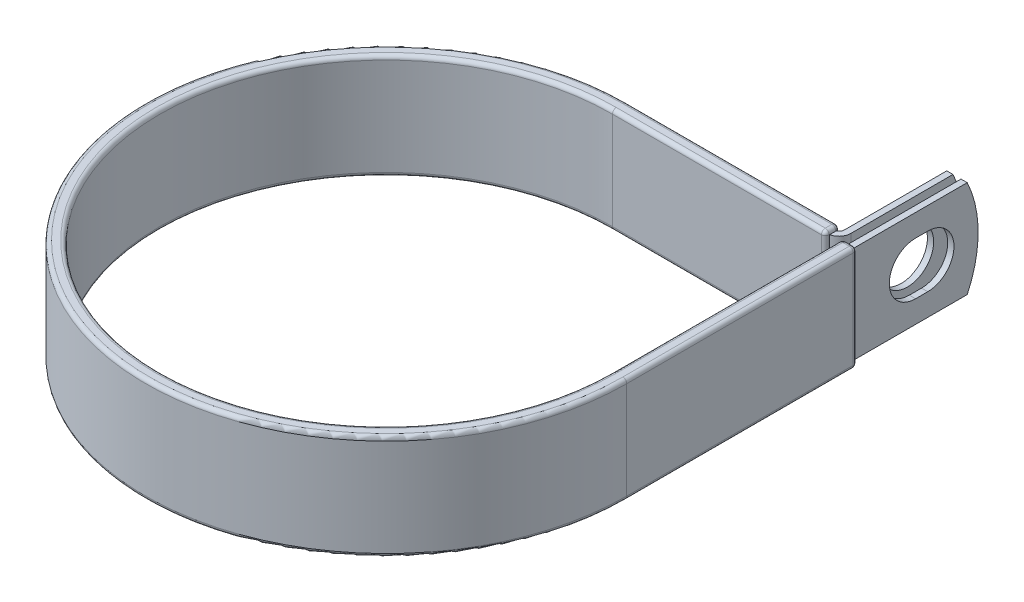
ISO-10303-21;
HEADER;
FILE_DESCRIPTION(('STEP AP214'),'2;1');
FILE_NAME('part.step','',(''),(''),'','','');
FILE_SCHEMA(('AUTOMOTIVE_DESIGN { 1 0 10303 214 1 1 1 1 }'));
ENDSEC;
DATA;
#1=APPLICATION_CONTEXT('core data for automotive mechanical design processes');
#2=APPLICATION_PROTOCOL_DEFINITION('international standard','automotive_design',2000,#1);
#3=PRODUCT_CONTEXT('',#1,'mechanical');
#4=PRODUCT('Part','Part','',(#3));
#5=PRODUCT_RELATED_PRODUCT_CATEGORY('part','',(#4));
#6=PRODUCT_DEFINITION_FORMATION('','',#4);
#7=PRODUCT_DEFINITION_CONTEXT('part definition',#1,'design');
#8=PRODUCT_DEFINITION('design','',#6,#7);
#9=PRODUCT_DEFINITION_SHAPE('','',#8);
#10=(LENGTH_UNIT() NAMED_UNIT(*) SI_UNIT(.MILLI.,.METRE.));
#11=(NAMED_UNIT(*) PLANE_ANGLE_UNIT() SI_UNIT($,.RADIAN.));
#12=(NAMED_UNIT(*) SI_UNIT($,.STERADIAN.) SOLID_ANGLE_UNIT());
#13=UNCERTAINTY_MEASURE_WITH_UNIT(LENGTH_MEASURE(1.E-05),#10,'distance_accuracy_value','');
#14=(GEOMETRIC_REPRESENTATION_CONTEXT(3) GLOBAL_UNCERTAINTY_ASSIGNED_CONTEXT((#13)) GLOBAL_UNIT_ASSIGNED_CONTEXT((#10,
#11,#12)) REPRESENTATION_CONTEXT('',''));
#15=CARTESIAN_POINT('',(0.,0.,0.));
#16=DIRECTION('',(0.,0.,1.));
#17=DIRECTION('',(1.,0.,0.));
#18=AXIS2_PLACEMENT_3D('',#15,#16,#17);
#19=CARTESIAN_POINT('',(43.66895,9.525,-69.8246));
#20=DIRECTION('',(1.,0.,0.));
#21=DIRECTION('',(0.,0.,-1.));
#22=AXIS2_PLACEMENT_3D('',#19,#20,#21);
#23=PLANE('',#22);
#24=CARTESIAN_POINT('',(43.66895,0.,-58.7248));
#25=DIRECTION('',(1.,0.,0.));
#26=DIRECTION('',(0.,0.,-1.));
#27=AXIS2_PLACEMENT_3D('',#24,#25,#26);
#28=CIRCLE('',#27,5.1562);
#29=CARTESIAN_POINT('',(43.66895,0.,-63.881));
#30=VERTEX_POINT('',#29);
#31=EDGE_CURVE('E460',#30,#30,#28,.F.);
#32=ORIENTED_EDGE('',*,*,#31,.T.);
#33=EDGE_LOOP('',(#32));
#34=FACE_BOUND('',#33,.T.);
#35=DIRECTION('',(0.,0.,1.));
#36=VECTOR('',#35,1.);
#37=CARTESIAN_POINT('',(43.66895,-9.525,-69.8246));
#38=LINE('',#37,#36);
#39=CARTESIAN_POINT('',(43.66895,-9.525,-67.6800631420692));
#40=VERTEX_POINT('',#39);
#41=CARTESIAN_POINT('',(43.66895,-9.525,-47.62119));
#42=VERTEX_POINT('',#41);
#43=EDGE_CURVE('E482',#40,#42,#38,.T.);
#44=ORIENTED_EDGE('',*,*,#43,.F.);
#45=CARTESIAN_POINT('',(43.66895,0.,-47.5996));
#46=DIRECTION('',(1.,0.,0.));
#47=DIRECTION('',(0.,0.,-1.));
#48=AXIS2_PLACEMENT_3D('',#45,#46,#47);
#49=CIRCLE('',#48,22.225);
#50=CARTESIAN_POINT('',(43.66895,9.525,-67.6800631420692));
#51=VERTEX_POINT('',#50);
#52=EDGE_CURVE('E419',#40,#51,#49,.T.);
#53=ORIENTED_EDGE('',*,*,#52,.T.);
#54=DIRECTION('',(0.,0.,1.));
#55=VECTOR('',#54,1.);
#56=CARTESIAN_POINT('',(43.66895,9.525,-69.8246));
#57=LINE('',#56,#55);
#58=CARTESIAN_POINT('',(43.66895,9.525,-47.62119));
#59=VERTEX_POINT('',#58);
#60=EDGE_CURVE('E472',#51,#59,#57,.T.);
#61=ORIENTED_EDGE('',*,*,#60,.T.);
#62=DIRECTION('',(0.,-1.,0.));
#63=VECTOR('',#62,1.);
#64=CARTESIAN_POINT('',(43.66895,9.525,-47.62119));
#65=LINE('',#64,#63);
#66=EDGE_CURVE('E489',#59,#42,#65,.T.);
#67=ORIENTED_EDGE('',*,*,#66,.T.);
#68=EDGE_LOOP('',(#44,#53,#61,#67));
#69=FACE_BOUND('',#68,.T.);
#70=ADVANCED_FACE('F54',(#34,#69),#23,.T.);
#71=CARTESIAN_POINT('',(42.44975,9.525,-69.8246));
#72=DIRECTION('',(1.,0.,0.));
#73=DIRECTION('',(0.,0.,-1.));
#74=AXIS2_PLACEMENT_3D('',#71,#72,#73);
#75=PLANE('',#74);
#76=CARTESIAN_POINT('',(42.44975,0.,-58.7248));
#77=DIRECTION('',(-1.,0.,0.));
#78=DIRECTION('',(0.,0.,1.));
#79=AXIS2_PLACEMENT_3D('',#76,#77,#78);
#80=CIRCLE('',#79,5.1562);
#81=CARTESIAN_POINT('',(42.44975,0.,-53.5686));
#82=VERTEX_POINT('',#81);
#83=EDGE_CURVE('E457',#82,#82,#80,.T.);
#84=ORIENTED_EDGE('',*,*,#83,.F.);
#85=EDGE_LOOP('',(#84));
#86=FACE_BOUND('',#85,.T.);
#87=CARTESIAN_POINT('',(42.44975,0.,-47.5996));
#88=DIRECTION('',(-1.,0.,0.));
#89=DIRECTION('',(0.,0.,1.));
#90=AXIS2_PLACEMENT_3D('',#87,#88,#89);
#91=CIRCLE('',#90,22.225);
#92=CARTESIAN_POINT('',(42.44975,9.525,-67.6800631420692));
#93=VERTEX_POINT('',#92);
#94=CARTESIAN_POINT('',(42.44975,-9.525,-67.6800631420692));
#95=VERTEX_POINT('',#94);
#96=EDGE_CURVE('E411',#93,#95,#91,.T.);
#97=ORIENTED_EDGE('',*,*,#96,.T.);
#98=DIRECTION('',(0.,0.,1.));
#99=VECTOR('',#98,1.);
#100=CARTESIAN_POINT('',(42.44975,-9.525,-69.8246));
#101=LINE('',#100,#99);
#102=CARTESIAN_POINT('',(42.44975,-9.525,-47.62119));
#103=VERTEX_POINT('',#102);
#104=EDGE_CURVE('E484',#95,#103,#101,.T.);
#105=ORIENTED_EDGE('',*,*,#104,.T.);
#106=DIRECTION('',(0.,-1.,0.));
#107=VECTOR('',#106,1.);
#108=CARTESIAN_POINT('',(42.44975,9.525,-47.62119));
#109=LINE('',#108,#107);
#110=CARTESIAN_POINT('',(42.44975,9.525,-47.62119));
#111=VERTEX_POINT('',#110);
#112=EDGE_CURVE('E477',#111,#103,#109,.T.);
#113=ORIENTED_EDGE('',*,*,#112,.F.);
#114=DIRECTION('',(0.,0.,1.));
#115=VECTOR('',#114,1.);
#116=CARTESIAN_POINT('',(42.44975,9.525,-69.8246));
#117=LINE('',#116,#115);
#118=EDGE_CURVE('E474',#93,#111,#117,.T.);
#119=ORIENTED_EDGE('',*,*,#118,.F.);
#120=EDGE_LOOP('',(#97,#105,#113,#119));
#121=FACE_BOUND('',#120,.T.);
#122=ADVANCED_FACE('F788',(#86,#121),#75,.F.);
#123=CARTESIAN_POINT('',(0.,-9.525,0.));
#124=DIRECTION('',(0.,1.,0.));
#125=DIRECTION('',(1.,0.,0.));
#126=AXIS2_PLACEMENT_3D('',#123,#124,#125);
#127=PLANE('',#126);
#128=CARTESIAN_POINT('',(41.29151,-9.525,-47.62119));
#129=DIRECTION('',(0.,-1.,0.));
#130=DIRECTION('',(0.,0.,1.));
#131=AXIS2_PLACEMENT_3D('',#128,#129,#130);
#132=CIRCLE('',#131,2.37744);
#133=CARTESIAN_POINT('',(41.8147500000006,-9.525,-45.3020434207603));
#134=VERTEX_POINT('',#133);
#135=EDGE_CURVE('E479',#42,#134,#132,.T.);
#136=ORIENTED_EDGE('',*,*,#135,.T.);
#137=DIRECTION('',(0.,0.,-1.));
#138=VECTOR('',#137,1.);
#139=CARTESIAN_POINT('',(41.8147500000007,-9.525,-46.46295));
#140=LINE('',#139,#138);
#141=CARTESIAN_POINT('',(41.8147500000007,-9.525,-46.4947));
#142=VERTEX_POINT('',#141);
#143=EDGE_CURVE('E368',#134,#142,#140,.T.);
#144=ORIENTED_EDGE('',*,*,#143,.T.);
#145=CARTESIAN_POINT('',(41.0527500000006,-9.525,-46.4947));
#146=DIRECTION('',(0.,1.,0.));
#147=DIRECTION('',(0.,0.,1.));
#148=AXIS2_PLACEMENT_3D('',#145,#146,#147);
#149=CIRCLE('',#148,0.762);
#150=CARTESIAN_POINT('',(41.8093610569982,-9.525,-46.5851638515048));
#151=VERTEX_POINT('',#150);
#152=EDGE_CURVE('E554',#142,#151,#149,.T.);
#153=ORIENTED_EDGE('',*,*,#152,.T.);
#154=CARTESIAN_POINT('',(41.29151,-9.525,-47.62119));
#155=DIRECTION('',(0.,1.,0.));
#156=DIRECTION('',(1.,0.,0.));
#157=AXIS2_PLACEMENT_3D('',#154,#155,#156);
#158=CIRCLE('',#157,1.15824000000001);
#159=EDGE_CURVE('E77',#103,#151,#158,.F.);
#160=ORIENTED_EDGE('',*,*,#159,.F.);
#161=ORIENTED_EDGE('',*,*,#104,.F.);
#162=DIRECTION('',(-1.,0.,0.));
#163=VECTOR('',#162,1.);
#164=CARTESIAN_POINT('',(46.46295,-9.525,-67.6800631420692));
#165=LINE('',#164,#163);
#166=EDGE_CURVE('E498',#40,#95,#165,.T.);
#167=ORIENTED_EDGE('',*,*,#166,.F.);
#168=ORIENTED_EDGE('',*,*,#43,.T.);
#169=EDGE_LOOP('',(#136,#144,#153,#160,#161,#167,#168));
#170=FACE_BOUND('',#169,.T.);
#171=ADVANCED_FACE('F794',(#170),#127,.F.);
#172=CARTESIAN_POINT('',(0.,9.525,0.));
#173=DIRECTION('',(0.,1.,0.));
#174=DIRECTION('',(1.,0.,0.));
#175=AXIS2_PLACEMENT_3D('',#172,#173,#174);
#176=PLANE('',#175);
#177=DIRECTION('',(0.,0.,-1.));
#178=VECTOR('',#177,1.);
#179=CARTESIAN_POINT('',(41.81475,9.525,5.86542092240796E-13));
#180=LINE('',#179,#178);
#181=CARTESIAN_POINT('',(41.8147500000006,9.525,-45.3020434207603));
#182=VERTEX_POINT('',#181);
#183=CARTESIAN_POINT('',(41.8147500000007,9.525,-46.4947));
#184=VERTEX_POINT('',#183);
#185=EDGE_CURVE('E405',#182,#184,#180,.T.);
#186=ORIENTED_EDGE('',*,*,#185,.F.);
#187=CARTESIAN_POINT('',(41.29151,9.525,-47.62119));
#188=DIRECTION('',(0.,-1.,0.));
#189=DIRECTION('',(0.,0.,1.));
#190=AXIS2_PLACEMENT_3D('',#187,#188,#189);
#191=CIRCLE('',#190,2.37744);
#192=EDGE_CURVE('E469',#59,#182,#191,.T.);
#193=ORIENTED_EDGE('',*,*,#192,.F.);
#194=ORIENTED_EDGE('',*,*,#60,.F.);
#195=DIRECTION('',(-1.,0.,0.));
#196=VECTOR('',#195,1.);
#197=CARTESIAN_POINT('',(46.46295,9.525,-67.6800631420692));
#198=LINE('',#197,#196);
#199=EDGE_CURVE('E495',#51,#93,#198,.T.);
#200=ORIENTED_EDGE('',*,*,#199,.T.);
#201=ORIENTED_EDGE('',*,*,#118,.T.);
#202=CARTESIAN_POINT('',(41.29151,9.525,-47.62119));
#203=DIRECTION('',(0.,1.,0.));
#204=DIRECTION('',(1.,0.,0.));
#205=AXIS2_PLACEMENT_3D('',#202,#203,#204);
#206=CIRCLE('',#205,1.15824000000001);
#207=CARTESIAN_POINT('',(41.8093610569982,9.525,-46.5851638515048));
#208=VERTEX_POINT('',#207);
#209=EDGE_CURVE('E70',#111,#208,#206,.F.);
#210=ORIENTED_EDGE('',*,*,#209,.T.);
#211=CARTESIAN_POINT('',(41.0527500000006,9.525,-46.4947));
#212=DIRECTION('',(0.,1.,0.));
#213=DIRECTION('',(0.,0.,1.));
#214=AXIS2_PLACEMENT_3D('',#211,#212,#213);
#215=CIRCLE('',#214,0.762);
#216=EDGE_CURVE('E12',#208,#184,#215,.F.);
#217=ORIENTED_EDGE('',*,*,#216,.T.);
#218=EDGE_LOOP('',(#186,#193,#194,#200,#201,#210,#217));
#219=FACE_BOUND('',#218,.T.);
#220=ADVANCED_FACE('F802',(#219),#176,.T.);
#221=CARTESIAN_POINT('',(41.29151,9.525,-47.62119));
#222=DIRECTION('',(0.,-1.,0.));
#223=DIRECTION('',(0.,0.,-1.));
#224=AXIS2_PLACEMENT_3D('',#221,#222,#223);
#225=CYLINDRICAL_SURFACE('',#224,2.37744);
#226=ORIENTED_EDGE('',*,*,#135,.F.);
#227=ORIENTED_EDGE('',*,*,#66,.F.);
#228=ORIENTED_EDGE('',*,*,#192,.T.);
#229=CARTESIAN_POINT('',(41.29151,9.525,-47.62119));
#230=DIRECTION('',(0.,-1.,0.));
#231=DIRECTION('',(0.,0.,-1.));
#232=AXIS2_PLACEMENT_3D('',#229,#230,#231);
#233=CIRCLE('',#232,2.37744);
#234=CARTESIAN_POINT('',(41.29151,9.525,-45.24375));
#235=VERTEX_POINT('',#234);
#236=EDGE_CURVE('E402',#235,#182,#233,.F.);
#237=ORIENTED_EDGE('',*,*,#236,.F.);
#238=DIRECTION('',(0.,-1.,0.));
#239=VECTOR('',#238,1.);
#240=CARTESIAN_POINT('',(41.29151,9.525,-45.24375));
#241=LINE('',#240,#239);
#242=CARTESIAN_POINT('',(41.29151,-9.52500000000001,-45.24375));
#243=VERTEX_POINT('',#242);
#244=EDGE_CURVE('E492',#235,#243,#241,.T.);
#245=ORIENTED_EDGE('',*,*,#244,.T.);
#246=CARTESIAN_POINT('',(41.29151,-9.52500000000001,-47.62119));
#247=DIRECTION('',(0.,1.,0.));
#248=DIRECTION('',(-1.,0.,0.));
#249=AXIS2_PLACEMENT_3D('',#246,#247,#248);
#250=CIRCLE('',#249,2.37744);
#251=EDGE_CURVE('E400',#134,#243,#250,.F.);
#252=ORIENTED_EDGE('',*,*,#251,.F.);
#253=EDGE_LOOP('',(#226,#227,#228,#237,#245,#252));
#254=FACE_BOUND('',#253,.T.);
#255=ADVANCED_FACE('F799',(#254),#225,.T.);
#256=CARTESIAN_POINT('',(41.29151,9.525,-47.62119));
#257=DIRECTION('',(0.,-1.,0.));
#258=DIRECTION('',(0.,0.,-1.));
#259=AXIS2_PLACEMENT_3D('',#256,#257,#258);
#260=CYLINDRICAL_SURFACE('',#259,1.15824000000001);
#261=ORIENTED_EDGE('',*,*,#159,.T.);
#262=DIRECTION('',(0.,1.,0.));
#263=VECTOR('',#262,1.);
#264=CARTESIAN_POINT('',(41.8093610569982,-9.525,-46.5851638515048));
#265=LINE('',#264,#263);
#266=EDGE_CURVE('E63',#151,#208,#265,.T.);
#267=ORIENTED_EDGE('',*,*,#266,.T.);
#268=ORIENTED_EDGE('',*,*,#209,.F.);
#269=ORIENTED_EDGE('',*,*,#112,.T.);
#270=EDGE_LOOP('',(#261,#267,#268,#269));
#271=FACE_BOUND('',#270,.T.);
#272=ADVANCED_FACE('F801',(#271),#260,.F.);
#273=CARTESIAN_POINT('',(58.2528859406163,0.,-58.7248));
#274=DIRECTION('',(-1.,0.,0.));
#275=DIRECTION('',(0.,0.,1.));
#276=AXIS2_PLACEMENT_3D('',#273,#274,#275);
#277=CYLINDRICAL_SURFACE('',#276,5.1562);
#278=ORIENTED_EDGE('',*,*,#83,.T.);
#279=EDGE_LOOP('',(#278));
#280=FACE_BOUND('',#279,.T.);
#281=ORIENTED_EDGE('',*,*,#31,.F.);
#282=EDGE_LOOP('',(#281));
#283=FACE_BOUND('',#282,.T.);
#284=ADVANCED_FACE('F808',(#280,#283),#277,.F.);
#285=CARTESIAN_POINT('',(46.46295,0.,-47.5996));
#286=DIRECTION('',(-1.,0.,0.));
#287=DIRECTION('',(0.,0.,1.));
#288=AXIS2_PLACEMENT_3D('',#285,#286,#287);
#289=CYLINDRICAL_SURFACE('',#288,22.225);
#290=ORIENTED_EDGE('',*,*,#52,.F.);
#291=ORIENTED_EDGE('',*,*,#166,.T.);
#292=ORIENTED_EDGE('',*,*,#96,.F.);
#293=ORIENTED_EDGE('',*,*,#199,.F.);
#294=EDGE_LOOP('',(#290,#291,#292,#293));
#295=FACE_BOUND('',#294,.T.);
#296=ADVANCED_FACE('F859',(#295),#289,.T.);
#297=CARTESIAN_POINT('',(6.34641215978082E-13,-9.525,-45.24375));
#298=DIRECTION('',(0.,0.,1.));
#299=DIRECTION('',(1.,0.,0.));
#300=AXIS2_PLACEMENT_3D('',#297,#298,#299);
#301=PLANE('',#300);
#302=DIRECTION('',(1.,0.,0.));
#303=VECTOR('',#302,1.);
#304=CARTESIAN_POINT('',(6.34641215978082E-13,-9.525,-45.24375));
#305=LINE('',#304,#303);
#306=CARTESIAN_POINT('',(41.8147500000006,-9.525,-45.24375));
#307=VERTEX_POINT('',#306);
#308=EDGE_CURVE('E375',#243,#307,#305,.T.);
#309=ORIENTED_EDGE('',*,*,#308,.F.);
#310=ORIENTED_EDGE('',*,*,#244,.F.);
#311=DIRECTION('',(1.,0.,0.));
#312=VECTOR('',#311,1.);
#313=CARTESIAN_POINT('',(6.34641215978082E-13,9.525,-45.24375));
#314=LINE('',#313,#312);
#315=CARTESIAN_POINT('',(41.8147500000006,9.525,-45.24375));
#316=VERTEX_POINT('',#315);
#317=EDGE_CURVE('E377',#235,#316,#314,.T.);
#318=ORIENTED_EDGE('',*,*,#317,.T.);
#319=DIRECTION('',(0.,-1.,0.));
#320=VECTOR('',#319,1.);
#321=CARTESIAN_POINT('',(41.8147500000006,-9.525,-45.24375));
#322=LINE('',#321,#320);
#323=EDGE_CURVE('E307',#316,#307,#322,.T.);
#324=ORIENTED_EDGE('',*,*,#323,.T.);
#325=EDGE_LOOP('',(#309,#310,#318,#324));
#326=FACE_BOUND('',#325,.T.);
#327=ADVANCED_FACE('F831',(#326),#301,.F.);
#328=CARTESIAN_POINT('',(41.8147500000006,-9.55675,-45.212));
#329=DIRECTION('',(1.,0.,0.));
#330=DIRECTION('',(0.,0.,-1.));
#331=AXIS2_PLACEMENT_3D('',#328,#329,#330);
#332=PLANE('',#331);
#333=DIRECTION('',(0.,0.,-1.));
#334=VECTOR('',#333,1.);
#335=CARTESIAN_POINT('',(41.8147500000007,-9.55675,-46.4947));
#336=LINE('',#335,#334);
#337=CARTESIAN_POINT('',(41.8147500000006,-9.55675,-45.212));
#338=VERTEX_POINT('',#337);
#339=CARTESIAN_POINT('',(41.8147500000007,-9.55675,-46.4947));
#340=VERTEX_POINT('',#339);
#341=EDGE_CURVE('E508',#338,#340,#336,.T.);
#342=ORIENTED_EDGE('',*,*,#341,.T.);
#343=DIRECTION('',(0.,1.,0.));
#344=VECTOR('',#343,1.);
#345=CARTESIAN_POINT('',(41.8147500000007,-9.55675,-46.4947));
#346=LINE('',#345,#344);
#347=EDGE_CURVE('E512',#340,#142,#346,.T.);
#348=ORIENTED_EDGE('',*,*,#347,.T.);
#349=ORIENTED_EDGE('',*,*,#143,.F.);
#350=EDGE_CURVE('E369',#307,#134,#140,.T.);
#351=ORIENTED_EDGE('',*,*,#350,.F.);
#352=ORIENTED_EDGE('',*,*,#323,.F.);
#353=DIRECTION('',(0.,0.,1.));
#354=VECTOR('',#353,1.);
#355=CARTESIAN_POINT('',(41.8147500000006,9.525,-45.24375));
#356=LINE('',#355,#354);
#357=EDGE_CURVE('E372',#182,#316,#356,.T.);
#358=ORIENTED_EDGE('',*,*,#357,.F.);
#359=ORIENTED_EDGE('',*,*,#185,.T.);
#360=DIRECTION('',(0.,1.,0.));
#361=VECTOR('',#360,1.);
#362=CARTESIAN_POINT('',(41.8147500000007,-9.55675,-46.4947));
#363=LINE('',#362,#361);
#364=CARTESIAN_POINT('',(41.8147500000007,9.55675,-46.4947));
#365=VERTEX_POINT('',#364);
#366=EDGE_CURVE('E510',#184,#365,#363,.T.);
#367=ORIENTED_EDGE('',*,*,#366,.T.);
#368=DIRECTION('',(0.,0.,1.));
#369=VECTOR('',#368,1.);
#370=CARTESIAN_POINT('',(41.8147500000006,9.55675,-45.212));
#371=LINE('',#370,#369);
#372=CARTESIAN_POINT('',(41.8147500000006,9.55675,-45.212));
#373=VERTEX_POINT('',#372);
#374=EDGE_CURVE('E504',#365,#373,#371,.T.);
#375=ORIENTED_EDGE('',*,*,#374,.T.);
#376=DIRECTION('',(0.,-1.,0.));
#377=VECTOR('',#376,1.);
#378=CARTESIAN_POINT('',(41.8147500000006,-9.55675,-45.212));
#379=LINE('',#378,#377);
#380=EDGE_CURVE('E506',#373,#338,#379,.T.);
#381=ORIENTED_EDGE('',*,*,#380,.T.);
#382=EDGE_LOOP('',(#342,#348,#349,#351,#352,#358,#359,#367,#375,#381));
#383=FACE_BOUND('',#382,.T.);
#384=ADVANCED_FACE('F827',(#383),#332,.T.);
#385=CARTESIAN_POINT('',(6.52188488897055E-13,-9.55675,-46.4947));
#386=DIRECTION('',(1.,0.,0.));
#387=DIRECTION('',(0.,0.,-1.));
#388=AXIS2_PLACEMENT_3D('',#385,#386,#387);
#389=CYLINDRICAL_SURFACE('',#388,0.761999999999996);
#390=DIRECTION('',(1.,0.,0.));
#391=VECTOR('',#390,1.);
#392=CARTESIAN_POINT('',(6.62877183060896E-13,-9.55675,-47.2567));
#393=LINE('',#392,#391);
#394=CARTESIAN_POINT('',(6.62877183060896E-13,-9.55675,-47.2567));
#395=VERTEX_POINT('',#394);
#396=CARTESIAN_POINT('',(41.0527500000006,-9.55675,-47.2567));
#397=VERTEX_POINT('',#396);
#398=EDGE_CURVE('E394',#395,#397,#393,.T.);
#399=ORIENTED_EDGE('',*,*,#398,.T.);
#400=CARTESIAN_POINT('',(41.0527500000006,-9.55675,-46.4947));
#401=DIRECTION('',(1.,0.,0.));
#402=DIRECTION('',(0.,0.,-1.));
#403=AXIS2_PLACEMENT_3D('',#400,#401,#402);
#404=CIRCLE('',#403,0.761999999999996);
#405=CARTESIAN_POINT('',(41.0527500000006,-10.31875,-46.4947));
#406=VERTEX_POINT('',#405);
#407=EDGE_CURVE('E517',#397,#406,#404,.F.);
#408=ORIENTED_EDGE('',*,*,#407,.T.);
#409=DIRECTION('',(1.,0.,0.));
#410=VECTOR('',#409,1.);
#411=CARTESIAN_POINT('',(6.52188488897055E-13,-10.31875,-46.4947));
#412=LINE('',#411,#410);
#413=CARTESIAN_POINT('',(6.52188488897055E-13,-10.31875,-46.4947));
#414=VERTEX_POINT('',#413);
#415=EDGE_CURVE('E397',#414,#406,#412,.T.);
#416=ORIENTED_EDGE('',*,*,#415,.F.);
#417=CARTESIAN_POINT('',(6.52188488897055E-13,-9.55675,-46.4947));
#418=DIRECTION('',(1.,0.,0.));
#419=DIRECTION('',(0.,0.,1.));
#420=AXIS2_PLACEMENT_3D('',#417,#418,#419);
#421=CIRCLE('',#420,0.761999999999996);
#422=EDGE_CURVE('E345',#414,#395,#421,.T.);
#423=ORIENTED_EDGE('',*,*,#422,.T.);
#424=EDGE_LOOP('',(#399,#408,#416,#423));
#425=FACE_BOUND('',#424,.T.);
#426=ADVANCED_FACE('F670',(#425),#389,.T.);
#427=CARTESIAN_POINT('',(6.62877183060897E-13,9.55675,-47.2567));
#428=DIRECTION('',(0.,0.,-1.));
#429=DIRECTION('',(0.,1.,0.));
#430=AXIS2_PLACEMENT_3D('',#427,#428,#429);
#431=PLANE('',#430);
#432=DIRECTION('',(1.,0.,0.));
#433=VECTOR('',#432,1.);
#434=CARTESIAN_POINT('',(6.62877183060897E-13,9.55675,-47.2567));
#435=LINE('',#434,#433);
#436=CARTESIAN_POINT('',(6.62877183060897E-13,9.55675,-47.2567));
#437=VERTEX_POINT('',#436);
#438=CARTESIAN_POINT('',(41.0527500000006,9.55675,-47.2567));
#439=VERTEX_POINT('',#438);
#440=EDGE_CURVE('E391',#437,#439,#435,.T.);
#441=ORIENTED_EDGE('',*,*,#440,.T.);
#442=DIRECTION('',(0.,1.,0.));
#443=VECTOR('',#442,1.);
#444=CARTESIAN_POINT('',(41.0527500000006,9.55675,-47.2567));
#445=LINE('',#444,#443);
#446=EDGE_CURVE('E515',#439,#397,#445,.F.);
#447=ORIENTED_EDGE('',*,*,#446,.T.);
#448=ORIENTED_EDGE('',*,*,#398,.F.);
#449=DIRECTION('',(0.,1.,0.));
#450=VECTOR('',#449,1.);
#451=CARTESIAN_POINT('',(6.62877183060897E-13,9.55675,-47.2567));
#452=LINE('',#451,#450);
#453=EDGE_CURVE('E342',#395,#437,#452,.T.);
#454=ORIENTED_EDGE('',*,*,#453,.T.);
#455=EDGE_LOOP('',(#441,#447,#448,#454));
#456=FACE_BOUND('',#455,.T.);
#457=ADVANCED_FACE('F676',(#456),#431,.T.);
#458=CARTESIAN_POINT('',(6.52188488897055E-13,9.55675,-46.4947));
#459=DIRECTION('',(1.,0.,0.));
#460=DIRECTION('',(0.,0.,-1.));
#461=AXIS2_PLACEMENT_3D('',#458,#459,#460);
#462=CYLINDRICAL_SURFACE('',#461,0.762);
#463=DIRECTION('',(1.,0.,0.));
#464=VECTOR('',#463,1.);
#465=CARTESIAN_POINT('',(6.52188488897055E-13,10.31875,-46.4947));
#466=LINE('',#465,#464);
#467=CARTESIAN_POINT('',(6.52188488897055E-13,10.31875,-46.4947));
#468=VERTEX_POINT('',#467);
#469=CARTESIAN_POINT('',(41.0527500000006,10.31875,-46.4947));
#470=VERTEX_POINT('',#469);
#471=EDGE_CURVE('E388',#468,#470,#466,.T.);
#472=ORIENTED_EDGE('',*,*,#471,.T.);
#473=CARTESIAN_POINT('',(41.0527500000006,9.55675,-46.4947));
#474=DIRECTION('',(1.,0.,0.));
#475=DIRECTION('',(0.,0.,-1.));
#476=AXIS2_PLACEMENT_3D('',#473,#474,#475);
#477=CIRCLE('',#476,0.762);
#478=EDGE_CURVE('E501',#470,#439,#477,.F.);
#479=ORIENTED_EDGE('',*,*,#478,.T.);
#480=ORIENTED_EDGE('',*,*,#440,.F.);
#481=CARTESIAN_POINT('',(6.52188488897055E-13,9.55675,-46.4947));
#482=DIRECTION('',(1.,0.,0.));
#483=DIRECTION('',(0.,0.,1.));
#484=AXIS2_PLACEMENT_3D('',#481,#482,#483);
#485=CIRCLE('',#484,0.762);
#486=EDGE_CURVE('E339',#437,#468,#485,.T.);
#487=ORIENTED_EDGE('',*,*,#486,.T.);
#488=EDGE_LOOP('',(#472,#479,#480,#487));
#489=FACE_BOUND('',#488,.T.);
#490=ADVANCED_FACE('F680',(#489),#462,.T.);
#491=CARTESIAN_POINT('',(6.34195853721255E-13,9.55675,-45.212));
#492=DIRECTION('',(1.,0.,0.));
#493=DIRECTION('',(0.,0.,-1.));
#494=AXIS2_PLACEMENT_3D('',#491,#492,#493);
#495=CYLINDRICAL_SURFACE('',#494,0.761999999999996);
#496=DIRECTION('',(1.,0.,0.));
#497=VECTOR('',#496,1.);
#498=CARTESIAN_POINT('',(6.23507159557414E-13,9.55675,-44.45));
#499=LINE('',#498,#497);
#500=CARTESIAN_POINT('',(6.23507159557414E-13,9.55675,-44.45));
#501=VERTEX_POINT('',#500);
#502=CARTESIAN_POINT('',(41.0527500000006,9.55675,-44.45));
#503=VERTEX_POINT('',#502);
#504=EDGE_CURVE('E382',#501,#503,#499,.T.);
#505=ORIENTED_EDGE('',*,*,#504,.T.);
#506=CARTESIAN_POINT('',(41.0527500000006,9.55675,-45.212));
#507=DIRECTION('',(1.,0.,0.));
#508=DIRECTION('',(0.,0.,-1.));
#509=AXIS2_PLACEMENT_3D('',#506,#507,#508);
#510=CIRCLE('',#509,0.761999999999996);
#511=CARTESIAN_POINT('',(41.0527500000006,10.31875,-45.212));
#512=VERTEX_POINT('',#511);
#513=EDGE_CURVE('E527',#503,#512,#510,.F.);
#514=ORIENTED_EDGE('',*,*,#513,.T.);
#515=DIRECTION('',(1.,0.,0.));
#516=VECTOR('',#515,1.);
#517=CARTESIAN_POINT('',(6.34195853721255E-13,10.31875,-45.212));
#518=LINE('',#517,#516);
#519=CARTESIAN_POINT('',(6.34195853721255E-13,10.31875,-45.212));
#520=VERTEX_POINT('',#519);
#521=EDGE_CURVE('E385',#520,#512,#518,.T.);
#522=ORIENTED_EDGE('',*,*,#521,.F.);
#523=CARTESIAN_POINT('',(6.34195853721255E-13,9.55675,-45.212));
#524=DIRECTION('',(1.,0.,0.));
#525=DIRECTION('',(0.,0.,1.));
#526=AXIS2_PLACEMENT_3D('',#523,#524,#525);
#527=CIRCLE('',#526,0.761999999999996);
#528=EDGE_CURVE('E336',#520,#501,#527,.T.);
#529=ORIENTED_EDGE('',*,*,#528,.T.);
#530=EDGE_LOOP('',(#505,#514,#522,#529));
#531=FACE_BOUND('',#530,.T.);
#532=ADVANCED_FACE('F721',(#531),#495,.T.);
#533=CARTESIAN_POINT('',(6.23507159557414E-13,-9.55675,-44.45));
#534=DIRECTION('',(0.,0.,1.));
#535=DIRECTION('',(0.,-1.,0.));
#536=AXIS2_PLACEMENT_3D('',#533,#534,#535);
#537=PLANE('',#536);
#538=DIRECTION('',(1.,0.,0.));
#539=VECTOR('',#538,1.);
#540=CARTESIAN_POINT('',(6.23507159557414E-13,-9.55675,-44.45));
#541=LINE('',#540,#539);
#542=CARTESIAN_POINT('',(6.23507159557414E-13,-9.55675,-44.45));
#543=VERTEX_POINT('',#542);
#544=CARTESIAN_POINT('',(41.0527500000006,-9.55675,-44.45));
#545=VERTEX_POINT('',#544);
#546=EDGE_CURVE('E379',#543,#545,#541,.T.);
#547=ORIENTED_EDGE('',*,*,#546,.T.);
#548=DIRECTION('',(0.,-1.,0.));
#549=VECTOR('',#548,1.);
#550=CARTESIAN_POINT('',(41.0527500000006,-9.55675,-44.45));
#551=LINE('',#550,#549);
#552=EDGE_CURVE('E525',#545,#503,#551,.F.);
#553=ORIENTED_EDGE('',*,*,#552,.T.);
#554=ORIENTED_EDGE('',*,*,#504,.F.);
#555=DIRECTION('',(0.,-1.,0.));
#556=VECTOR('',#555,1.);
#557=CARTESIAN_POINT('',(6.23507159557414E-13,-9.55675,-44.45));
#558=LINE('',#557,#556);
#559=EDGE_CURVE('E327',#501,#543,#558,.T.);
#560=ORIENTED_EDGE('',*,*,#559,.T.);
#561=EDGE_LOOP('',(#547,#553,#554,#560));
#562=FACE_BOUND('',#561,.T.);
#563=ADVANCED_FACE('F719',(#562),#537,.T.);
#564=CARTESIAN_POINT('',(6.34195853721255E-13,-9.55675,-45.212));
#565=DIRECTION('',(1.,0.,0.));
#566=DIRECTION('',(0.,0.,-1.));
#567=AXIS2_PLACEMENT_3D('',#564,#565,#566);
#568=CYLINDRICAL_SURFACE('',#567,0.762000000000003);
#569=DIRECTION('',(1.,0.,0.));
#570=VECTOR('',#569,1.);
#571=CARTESIAN_POINT('',(6.34195853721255E-13,-10.31875,-45.212));
#572=LINE('',#571,#570);
#573=CARTESIAN_POINT('',(6.34195853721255E-13,-10.31875,-45.212));
#574=VERTEX_POINT('',#573);
#575=CARTESIAN_POINT('',(41.0527500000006,-10.31875,-45.212));
#576=VERTEX_POINT('',#575);
#577=EDGE_CURVE('E303',#574,#576,#572,.T.);
#578=ORIENTED_EDGE('',*,*,#577,.T.);
#579=CARTESIAN_POINT('',(41.0527500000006,-9.55675,-45.212));
#580=DIRECTION('',(1.,0.,0.));
#581=DIRECTION('',(0.,0.,-1.));
#582=AXIS2_PLACEMENT_3D('',#579,#580,#581);
#583=CIRCLE('',#582,0.762000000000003);
#584=EDGE_CURVE('E523',#576,#545,#583,.F.);
#585=ORIENTED_EDGE('',*,*,#584,.T.);
#586=ORIENTED_EDGE('',*,*,#546,.F.);
#587=CARTESIAN_POINT('',(6.34195853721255E-13,-9.55675,-45.212));
#588=DIRECTION('',(1.,0.,0.));
#589=DIRECTION('',(0.,0.,-1.));
#590=AXIS2_PLACEMENT_3D('',#587,#588,#589);
#591=CIRCLE('',#590,0.762000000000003);
#592=EDGE_CURVE('E324',#543,#574,#591,.T.);
#593=ORIENTED_EDGE('',*,*,#592,.T.);
#594=EDGE_LOOP('',(#578,#585,#586,#593));
#595=FACE_BOUND('',#594,.T.);
#596=ADVANCED_FACE('F709',(#595),#568,.T.);
#597=CARTESIAN_POINT('',(0.,-9.55675,0.));
#598=DIRECTION('',(0.,-1.,0.));
#599=DIRECTION('',(0.,0.,-1.));
#600=AXIS2_PLACEMENT_3D('',#597,#598,#599);
#601=TOROIDAL_SURFACE('',#600,46.4947,0.761999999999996);
#602=CARTESIAN_POINT('',(46.4947,-9.55675,0.));
#603=DIRECTION('',(0.,0.,1.));
#604=DIRECTION('',(-1.,0.,0.));
#605=AXIS2_PLACEMENT_3D('',#602,#603,#604);
#606=CIRCLE('',#605,0.761999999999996);
#607=CARTESIAN_POINT('',(46.4947,-10.31875,0.));
#608=VERTEX_POINT('',#607);
#609=CARTESIAN_POINT('',(47.2567,-9.55675,0.));
#610=VERTEX_POINT('',#609);
#611=EDGE_CURVE('E318',#608,#610,#606,.T.);
#612=ORIENTED_EDGE('',*,*,#611,.T.);
#613=CARTESIAN_POINT('',(0.,-9.55675,0.));
#614=DIRECTION('',(0.,-1.,0.));
#615=DIRECTION('',(0.,0.,-1.));
#616=AXIS2_PLACEMENT_3D('',#613,#614,#615);
#617=CIRCLE('',#616,47.2567);
#618=EDGE_CURVE('E361',#610,#395,#617,.T.);
#619=ORIENTED_EDGE('',*,*,#618,.T.);
#620=ORIENTED_EDGE('',*,*,#422,.F.);
#621=CARTESIAN_POINT('',(0.,-10.31875,0.));
#622=DIRECTION('',(0.,-1.,0.));
#623=DIRECTION('',(0.,0.,-1.));
#624=AXIS2_PLACEMENT_3D('',#621,#622,#623);
#625=CIRCLE('',#624,46.4947);
#626=EDGE_CURVE('E308',#608,#414,#625,.T.);
#627=ORIENTED_EDGE('',*,*,#626,.F.);
#628=EDGE_LOOP('',(#612,#619,#620,#627));
#629=FACE_BOUND('',#628,.T.);
#630=ADVANCED_FACE('F667',(#629),#601,.T.);
#631=CARTESIAN_POINT('',(0.,9.525,0.));
#632=DIRECTION('',(0.,-1.,0.));
#633=DIRECTION('',(0.,0.,-1.));
#634=AXIS2_PLACEMENT_3D('',#631,#632,#633);
#635=CYLINDRICAL_SURFACE('',#634,47.2567);
#636=DIRECTION('',(0.,1.,0.));
#637=VECTOR('',#636,1.);
#638=CARTESIAN_POINT('',(47.2567,9.55675,0.));
#639=LINE('',#638,#637);
#640=CARTESIAN_POINT('',(47.2567,9.55675,0.));
#641=VERTEX_POINT('',#640);
#642=EDGE_CURVE('E655',#610,#641,#639,.T.);
#643=ORIENTED_EDGE('',*,*,#642,.T.);
#644=CARTESIAN_POINT('',(0.,9.55675,0.));
#645=DIRECTION('',(0.,-1.,0.));
#646=DIRECTION('',(0.,0.,-1.));
#647=AXIS2_PLACEMENT_3D('',#644,#645,#646);
#648=CIRCLE('',#647,47.2567);
#649=EDGE_CURVE('E358',#641,#437,#648,.T.);
#650=ORIENTED_EDGE('',*,*,#649,.T.);
#651=ORIENTED_EDGE('',*,*,#453,.F.);
#652=ORIENTED_EDGE('',*,*,#618,.F.);
#653=EDGE_LOOP('',(#643,#650,#651,#652));
#654=FACE_BOUND('',#653,.T.);
#655=ADVANCED_FACE('F673',(#654),#635,.T.);
#656=CARTESIAN_POINT('',(0.,9.55675,0.));
#657=DIRECTION('',(0.,-1.,0.));
#658=DIRECTION('',(0.,0.,-1.));
#659=AXIS2_PLACEMENT_3D('',#656,#657,#658);
#660=TOROIDAL_SURFACE('',#659,46.4947,0.762);
#661=CARTESIAN_POINT('',(46.4947,9.55675,0.));
#662=DIRECTION('',(0.,0.,1.));
#663=DIRECTION('',(-1.,0.,0.));
#664=AXIS2_PLACEMENT_3D('',#661,#662,#663);
#665=CIRCLE('',#664,0.762);
#666=CARTESIAN_POINT('',(46.4947,10.31875,0.));
#667=VERTEX_POINT('',#666);
#668=EDGE_CURVE('E734',#641,#667,#665,.T.);
#669=ORIENTED_EDGE('',*,*,#668,.T.);
#670=CARTESIAN_POINT('',(0.,10.31875,0.));
#671=DIRECTION('',(0.,-1.,0.));
#672=DIRECTION('',(0.,0.,-1.));
#673=AXIS2_PLACEMENT_3D('',#670,#671,#672);
#674=CIRCLE('',#673,46.4947);
#675=EDGE_CURVE('E355',#667,#468,#674,.T.);
#676=ORIENTED_EDGE('',*,*,#675,.T.);
#677=ORIENTED_EDGE('',*,*,#486,.F.);
#678=ORIENTED_EDGE('',*,*,#649,.F.);
#679=EDGE_LOOP('',(#669,#676,#677,#678));
#680=FACE_BOUND('',#679,.T.);
#681=ADVANCED_FACE('F678',(#680),#660,.T.);
#682=CARTESIAN_POINT('',(0.,9.55675,0.));
#683=DIRECTION('',(0.,-1.,0.));
#684=DIRECTION('',(0.,0.,-1.));
#685=AXIS2_PLACEMENT_3D('',#682,#683,#684);
#686=TOROIDAL_SURFACE('',#685,45.212,0.761999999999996);
#687=CARTESIAN_POINT('',(45.212,9.55675,0.));
#688=DIRECTION('',(0.,0.,1.));
#689=DIRECTION('',(-1.,0.,0.));
#690=AXIS2_PLACEMENT_3D('',#687,#688,#689);
#691=CIRCLE('',#690,0.761999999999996);
#692=CARTESIAN_POINT('',(45.212,10.31875,0.));
#693=VERTEX_POINT('',#692);
#694=CARTESIAN_POINT('',(44.45,9.55675,0.));
#695=VERTEX_POINT('',#694);
#696=EDGE_CURVE('E730',#693,#695,#691,.T.);
#697=ORIENTED_EDGE('',*,*,#696,.T.);
#698=CARTESIAN_POINT('',(0.,9.55675,0.));
#699=DIRECTION('',(0.,-1.,0.));
#700=DIRECTION('',(0.,0.,-1.));
#701=AXIS2_PLACEMENT_3D('',#698,#699,#700);
#702=CIRCLE('',#701,44.45);
#703=EDGE_CURVE('E349',#695,#501,#702,.T.);
#704=ORIENTED_EDGE('',*,*,#703,.T.);
#705=ORIENTED_EDGE('',*,*,#528,.F.);
#706=CARTESIAN_POINT('',(0.,10.31875,0.));
#707=DIRECTION('',(0.,-1.,0.));
#708=DIRECTION('',(0.,0.,-1.));
#709=AXIS2_PLACEMENT_3D('',#706,#707,#708);
#710=CIRCLE('',#709,45.212);
#711=EDGE_CURVE('E352',#693,#520,#710,.T.);
#712=ORIENTED_EDGE('',*,*,#711,.F.);
#713=EDGE_LOOP('',(#697,#704,#705,#712));
#714=FACE_BOUND('',#713,.T.);
#715=ADVANCED_FACE('F728',(#714),#686,.T.);
#716=CARTESIAN_POINT('',(0.,9.525,0.));
#717=DIRECTION('',(0.,-1.,0.));
#718=DIRECTION('',(0.,0.,-1.));
#719=AXIS2_PLACEMENT_3D('',#716,#717,#718);
#720=CYLINDRICAL_SURFACE('',#719,44.45);
#721=DIRECTION('',(0.,-1.,0.));
#722=VECTOR('',#721,1.);
#723=CARTESIAN_POINT('',(44.45,-9.55675,0.));
#724=LINE('',#723,#722);
#725=CARTESIAN_POINT('',(44.45,-9.55675,0.));
#726=VERTEX_POINT('',#725);
#727=EDGE_CURVE('E733',#695,#726,#724,.T.);
#728=ORIENTED_EDGE('',*,*,#727,.T.);
#729=CARTESIAN_POINT('',(0.,-9.55675,0.));
#730=DIRECTION('',(0.,-1.,0.));
#731=DIRECTION('',(0.,0.,-1.));
#732=AXIS2_PLACEMENT_3D('',#729,#730,#731);
#733=CIRCLE('',#732,44.45);
#734=EDGE_CURVE('E314',#726,#543,#733,.T.);
#735=ORIENTED_EDGE('',*,*,#734,.T.);
#736=ORIENTED_EDGE('',*,*,#559,.F.);
#737=ORIENTED_EDGE('',*,*,#703,.F.);
#738=EDGE_LOOP('',(#728,#735,#736,#737));
#739=FACE_BOUND('',#738,.T.);
#740=ADVANCED_FACE('F726',(#739),#720,.F.);
#741=CARTESIAN_POINT('',(0.,-9.55675,0.));
#742=DIRECTION('',(0.,-1.,0.));
#743=DIRECTION('',(0.,0.,-1.));
#744=AXIS2_PLACEMENT_3D('',#741,#742,#743);
#745=TOROIDAL_SURFACE('',#744,45.212,0.762000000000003);
#746=CARTESIAN_POINT('',(45.212,-9.55675,0.));
#747=DIRECTION('',(0.,0.,1.));
#748=DIRECTION('',(1.,0.,0.));
#749=AXIS2_PLACEMENT_3D('',#746,#747,#748);
#750=CIRCLE('',#749,0.762000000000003);
#751=CARTESIAN_POINT('',(45.212,-10.31875,0.));
#752=VERTEX_POINT('',#751);
#753=EDGE_CURVE('E311',#726,#752,#750,.T.);
#754=ORIENTED_EDGE('',*,*,#753,.T.);
#755=CARTESIAN_POINT('',(0.,-10.31875,0.));
#756=DIRECTION('',(0.,-1.,0.));
#757=DIRECTION('',(0.,0.,-1.));
#758=AXIS2_PLACEMENT_3D('',#755,#756,#757);
#759=CIRCLE('',#758,45.212);
#760=EDGE_CURVE('E295',#752,#574,#759,.T.);
#761=ORIENTED_EDGE('',*,*,#760,.T.);
#762=ORIENTED_EDGE('',*,*,#592,.F.);
#763=ORIENTED_EDGE('',*,*,#734,.F.);
#764=EDGE_LOOP('',(#754,#761,#762,#763));
#765=FACE_BOUND('',#764,.T.);
#766=ADVANCED_FACE('F312',(#765),#745,.T.);
#767=CARTESIAN_POINT('',(45.212,-9.55675,0.));
#768=DIRECTION('',(0.,0.,-1.));
#769=DIRECTION('',(-1.,0.,0.));
#770=AXIS2_PLACEMENT_3D('',#767,#768,#769);
#771=CYLINDRICAL_SURFACE('',#770,0.762000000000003);
#772=DIRECTION('',(0.,0.,-1.));
#773=VECTOR('',#772,1.);
#774=CARTESIAN_POINT('',(44.45,-9.55675,0.));
#775=LINE('',#774,#773);
#776=CARTESIAN_POINT('',(44.45,-9.55675,-44.48175));
#777=VERTEX_POINT('',#776);
#778=EDGE_CURVE('E741',#726,#777,#775,.T.);
#779=ORIENTED_EDGE('',*,*,#778,.T.);
#780=CARTESIAN_POINT('',(45.212,-9.55675,-44.48175));
#781=DIRECTION('',(0.,0.,-1.));
#782=DIRECTION('',(-1.,0.,0.));
#783=AXIS2_PLACEMENT_3D('',#780,#781,#782);
#784=CIRCLE('',#783,0.762000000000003);
#785=CARTESIAN_POINT('',(45.212,-10.31875,-44.48175));
#786=VERTEX_POINT('',#785);
#787=EDGE_CURVE('E323',#777,#786,#784,.F.);
#788=ORIENTED_EDGE('',*,*,#787,.T.);
#789=DIRECTION('',(0.,0.,-1.));
#790=VECTOR('',#789,1.);
#791=CARTESIAN_POINT('',(45.212,-10.31875,0.));
#792=LINE('',#791,#790);
#793=EDGE_CURVE('E300',#752,#786,#792,.T.);
#794=ORIENTED_EDGE('',*,*,#793,.F.);
#795=ORIENTED_EDGE('',*,*,#753,.F.);
#796=EDGE_LOOP('',(#779,#788,#794,#795));
#797=FACE_BOUND('',#796,.T.);
#798=ADVANCED_FACE('F321',(#797),#771,.T.);
#799=CARTESIAN_POINT('',(46.4947,-10.31875,0.));
#800=DIRECTION('',(0.,1.,0.));
#801=DIRECTION('',(0.,0.,1.));
#802=AXIS2_PLACEMENT_3D('',#799,#800,#801);
#803=PLANE('',#802);
#804=ORIENTED_EDGE('',*,*,#415,.T.);
#805=DIRECTION('',(0.,0.,-1.));
#806=VECTOR('',#805,1.);
#807=CARTESIAN_POINT('',(41.0527500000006,-10.31875,-45.212));
#808=LINE('',#807,#806);
#809=EDGE_CURVE('E521',#406,#576,#808,.F.);
#810=ORIENTED_EDGE('',*,*,#809,.T.);
#811=ORIENTED_EDGE('',*,*,#577,.F.);
#812=ORIENTED_EDGE('',*,*,#760,.F.);
#813=ORIENTED_EDGE('',*,*,#793,.T.);
#814=DIRECTION('',(1.,0.,0.));
#815=VECTOR('',#814,1.);
#816=CARTESIAN_POINT('',(46.4947,-10.31875,-44.48175));
#817=LINE('',#816,#815);
#818=CARTESIAN_POINT('',(46.4947,-10.31875,-44.48175));
#819=VERTEX_POINT('',#818);
#820=EDGE_CURVE('E519',#786,#819,#817,.T.);
#821=ORIENTED_EDGE('',*,*,#820,.T.);
#822=DIRECTION('',(0.,0.,-1.));
#823=VECTOR('',#822,1.);
#824=CARTESIAN_POINT('',(46.4947,-10.31875,0.));
#825=LINE('',#824,#823);
#826=EDGE_CURVE('E325',#608,#819,#825,.T.);
#827=ORIENTED_EDGE('',*,*,#826,.F.);
#828=ORIENTED_EDGE('',*,*,#626,.T.);
#829=EDGE_LOOP('',(#804,#810,#811,#812,#813,#821,#827,#828));
#830=FACE_BOUND('',#829,.T.);
#831=ADVANCED_FACE('F298',(#830),#803,.F.);
#832=CARTESIAN_POINT('',(46.4947,-9.55675,0.));
#833=DIRECTION('',(0.,0.,-1.));
#834=DIRECTION('',(-1.,0.,0.));
#835=AXIS2_PLACEMENT_3D('',#832,#833,#834);
#836=CYLINDRICAL_SURFACE('',#835,0.761999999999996);
#837=ORIENTED_EDGE('',*,*,#826,.T.);
#838=CARTESIAN_POINT('',(46.4947,-9.55675,-44.48175));
#839=DIRECTION('',(0.,0.,-1.));
#840=DIRECTION('',(-1.,0.,0.));
#841=AXIS2_PLACEMENT_3D('',#838,#839,#840);
#842=CIRCLE('',#841,0.761999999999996);
#843=CARTESIAN_POINT('',(47.2567,-9.55675,-44.48175));
#844=VERTEX_POINT('',#843);
#845=EDGE_CURVE('E543',#819,#844,#842,.F.);
#846=ORIENTED_EDGE('',*,*,#845,.T.);
#847=DIRECTION('',(0.,0.,-1.));
#848=VECTOR('',#847,1.);
#849=CARTESIAN_POINT('',(47.2567,-9.55675,0.));
#850=LINE('',#849,#848);
#851=EDGE_CURVE('E330',#610,#844,#850,.T.);
#852=ORIENTED_EDGE('',*,*,#851,.F.);
#853=ORIENTED_EDGE('',*,*,#611,.F.);
#854=EDGE_LOOP('',(#837,#846,#852,#853));
#855=FACE_BOUND('',#854,.T.);
#856=ADVANCED_FACE('F661',(#855),#836,.T.);
#857=CARTESIAN_POINT('',(47.2567,9.55675,0.));
#858=DIRECTION('',(-1.,0.,0.));
#859=DIRECTION('',(0.,-1.,0.));
#860=AXIS2_PLACEMENT_3D('',#857,#858,#859);
#861=PLANE('',#860);
#862=ORIENTED_EDGE('',*,*,#851,.T.);
#863=DIRECTION('',(0.,1.,0.));
#864=VECTOR('',#863,1.);
#865=CARTESIAN_POINT('',(47.2567,9.55675,-44.48175));
#866=LINE('',#865,#864);
#867=CARTESIAN_POINT('',(47.2567,9.55675,-44.48175));
#868=VERTEX_POINT('',#867);
#869=EDGE_CURVE('E532',#844,#868,#866,.T.);
#870=ORIENTED_EDGE('',*,*,#869,.T.);
#871=DIRECTION('',(0.,0.,-1.));
#872=VECTOR('',#871,1.);
#873=CARTESIAN_POINT('',(47.2567,9.55675,0.));
#874=LINE('',#873,#872);
#875=EDGE_CURVE('E640',#641,#868,#874,.T.);
#876=ORIENTED_EDGE('',*,*,#875,.F.);
#877=ORIENTED_EDGE('',*,*,#642,.F.);
#878=EDGE_LOOP('',(#862,#870,#876,#877));
#879=FACE_BOUND('',#878,.T.);
#880=ADVANCED_FACE('F653',(#879),#861,.F.);
#881=CARTESIAN_POINT('',(46.4947,9.55675,0.));
#882=DIRECTION('',(0.,0.,-1.));
#883=DIRECTION('',(-1.,0.,0.));
#884=AXIS2_PLACEMENT_3D('',#881,#882,#883);
#885=CYLINDRICAL_SURFACE('',#884,0.762);
#886=ORIENTED_EDGE('',*,*,#875,.T.);
#887=CARTESIAN_POINT('',(46.4947,9.55675,-44.48175));
#888=DIRECTION('',(0.,0.,-1.));
#889=DIRECTION('',(-1.,0.,0.));
#890=AXIS2_PLACEMENT_3D('',#887,#888,#889);
#891=CIRCLE('',#890,0.762);
#892=CARTESIAN_POINT('',(46.4947,10.31875,-44.48175));
#893=VERTEX_POINT('',#892);
#894=EDGE_CURVE('E529',#868,#893,#891,.F.);
#895=ORIENTED_EDGE('',*,*,#894,.T.);
#896=DIRECTION('',(0.,0.,-1.));
#897=VECTOR('',#896,1.);
#898=CARTESIAN_POINT('',(46.4947,10.31875,0.));
#899=LINE('',#898,#897);
#900=EDGE_CURVE('E638',#667,#893,#899,.T.);
#901=ORIENTED_EDGE('',*,*,#900,.F.);
#902=ORIENTED_EDGE('',*,*,#668,.F.);
#903=EDGE_LOOP('',(#886,#895,#901,#902));
#904=FACE_BOUND('',#903,.T.);
#905=ADVANCED_FACE('F636',(#904),#885,.T.);
#906=CARTESIAN_POINT('',(45.212,10.31875,0.));
#907=DIRECTION('',(0.,-1.,0.));
#908=DIRECTION('',(0.,0.,-1.));
#909=AXIS2_PLACEMENT_3D('',#906,#907,#908);
#910=PLANE('',#909);
#911=ORIENTED_EDGE('',*,*,#521,.T.);
#912=DIRECTION('',(0.,0.,1.));
#913=VECTOR('',#912,1.);
#914=CARTESIAN_POINT('',(41.0527500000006,10.31875,-46.4947));
#915=LINE('',#914,#913);
#916=EDGE_CURVE('E552',#512,#470,#915,.F.);
#917=ORIENTED_EDGE('',*,*,#916,.T.);
#918=ORIENTED_EDGE('',*,*,#471,.F.);
#919=ORIENTED_EDGE('',*,*,#675,.F.);
#920=ORIENTED_EDGE('',*,*,#900,.T.);
#921=DIRECTION('',(-1.,0.,0.));
#922=VECTOR('',#921,1.);
#923=CARTESIAN_POINT('',(45.212,10.31875,-44.48175));
#924=LINE('',#923,#922);
#925=CARTESIAN_POINT('',(45.212,10.31875,-44.48175));
#926=VERTEX_POINT('',#925);
#927=EDGE_CURVE('E550',#893,#926,#924,.T.);
#928=ORIENTED_EDGE('',*,*,#927,.T.);
#929=DIRECTION('',(0.,0.,-1.));
#930=VECTOR('',#929,1.);
#931=CARTESIAN_POINT('',(45.212,10.31875,0.));
#932=LINE('',#931,#930);
#933=EDGE_CURVE('E643',#693,#926,#932,.T.);
#934=ORIENTED_EDGE('',*,*,#933,.F.);
#935=ORIENTED_EDGE('',*,*,#711,.T.);
#936=EDGE_LOOP('',(#911,#917,#918,#919,#920,#928,#934,#935));
#937=FACE_BOUND('',#936,.T.);
#938=ADVANCED_FACE('F641',(#937),#910,.F.);
#939=CARTESIAN_POINT('',(45.212,9.55675,0.));
#940=DIRECTION('',(0.,0.,-1.));
#941=DIRECTION('',(-1.,0.,0.));
#942=AXIS2_PLACEMENT_3D('',#939,#940,#941);
#943=CYLINDRICAL_SURFACE('',#942,0.761999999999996);
#944=ORIENTED_EDGE('',*,*,#933,.T.);
#945=CARTESIAN_POINT('',(45.212,9.55675,-44.48175));
#946=DIRECTION('',(0.,0.,-1.));
#947=DIRECTION('',(-1.,0.,0.));
#948=AXIS2_PLACEMENT_3D('',#945,#946,#947);
#949=CIRCLE('',#948,0.761999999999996);
#950=CARTESIAN_POINT('',(44.45,9.55675,-44.48175));
#951=VERTEX_POINT('',#950);
#952=EDGE_CURVE('E548',#926,#951,#949,.F.);
#953=ORIENTED_EDGE('',*,*,#952,.T.);
#954=DIRECTION('',(0.,0.,-1.));
#955=VECTOR('',#954,1.);
#956=CARTESIAN_POINT('',(44.45,9.55675,0.));
#957=LINE('',#956,#955);
#958=EDGE_CURVE('E646',#695,#951,#957,.T.);
#959=ORIENTED_EDGE('',*,*,#958,.F.);
#960=ORIENTED_EDGE('',*,*,#696,.F.);
#961=EDGE_LOOP('',(#944,#953,#959,#960));
#962=FACE_BOUND('',#961,.T.);
#963=ADVANCED_FACE('F738',(#962),#943,.T.);
#964=CARTESIAN_POINT('',(45.24375,9.525,0.));
#965=DIRECTION('',(0.,-1.,0.));
#966=DIRECTION('',(0.,0.,-1.));
#967=AXIS2_PLACEMENT_3D('',#964,#965,#966);
#968=PLANE('',#967);
#969=ORIENTED_EDGE('',*,*,#317,.F.);
#970=ORIENTED_EDGE('',*,*,#236,.T.);
#971=ORIENTED_EDGE('',*,*,#357,.T.);
#972=EDGE_LOOP('',(#969,#970,#971));
#973=FACE_BOUND('',#972,.T.);
#974=ADVANCED_FACE('F825',(#973),#968,.T.);
#975=CARTESIAN_POINT('',(46.46295,-9.525,0.));
#976=DIRECTION('',(0.,1.,0.));
#977=DIRECTION('',(-1.,0.,0.));
#978=AXIS2_PLACEMENT_3D('',#975,#976,#977);
#979=PLANE('',#978);
#980=ORIENTED_EDGE('',*,*,#350,.T.);
#981=ORIENTED_EDGE('',*,*,#251,.T.);
#982=ORIENTED_EDGE('',*,*,#308,.T.);
#983=EDGE_LOOP('',(#980,#981,#982));
#984=FACE_BOUND('',#983,.T.);
#985=ADVANCED_FACE('F833',(#984),#979,.T.);
#986=CARTESIAN_POINT('',(44.45,-9.55675,0.));
#987=DIRECTION('',(1.,0.,0.));
#988=DIRECTION('',(0.,1.,0.));
#989=AXIS2_PLACEMENT_3D('',#986,#987,#988);
#990=PLANE('',#989);
#991=ORIENTED_EDGE('',*,*,#958,.T.);
#992=DIRECTION('',(0.,-1.,0.));
#993=VECTOR('',#992,1.);
#994=CARTESIAN_POINT('',(44.45,-9.55675,-44.48175));
#995=LINE('',#994,#993);
#996=EDGE_CURVE('E546',#951,#777,#995,.T.);
#997=ORIENTED_EDGE('',*,*,#996,.T.);
#998=ORIENTED_EDGE('',*,*,#778,.F.);
#999=ORIENTED_EDGE('',*,*,#727,.F.);
#1000=EDGE_LOOP('',(#991,#997,#998,#999));
#1001=FACE_BOUND('',#1000,.T.);
#1002=ADVANCED_FACE('F743',(#1001),#990,.F.);
#1003=CARTESIAN_POINT('',(45.212,-9.55675,-45.24375));
#1004=DIRECTION('',(0.,0.,1.));
#1005=DIRECTION('',(1.,0.,0.));
#1006=AXIS2_PLACEMENT_3D('',#1003,#1004,#1005);
#1007=PLANE('',#1006);
#1008=DIRECTION('',(-1.,0.,0.));
#1009=VECTOR('',#1008,1.);
#1010=CARTESIAN_POINT('',(45.212,9.55675,-45.24375));
#1011=LINE('',#1010,#1009);
#1012=CARTESIAN_POINT('',(45.212,9.55675,-45.24375));
#1013=VERTEX_POINT('',#1012);
#1014=CARTESIAN_POINT('',(46.4947,9.55675,-45.24375));
#1015=VERTEX_POINT('',#1014);
#1016=EDGE_CURVE('E534',#1013,#1015,#1011,.F.);
#1017=ORIENTED_EDGE('',*,*,#1016,.T.);
#1018=DIRECTION('',(0.,1.,0.));
#1019=VECTOR('',#1018,1.);
#1020=CARTESIAN_POINT('',(46.4947,-9.55675,-45.24375));
#1021=LINE('',#1020,#1019);
#1022=CARTESIAN_POINT('',(46.4947,-9.55675,-45.24375));
#1023=VERTEX_POINT('',#1022);
#1024=EDGE_CURVE('E540',#1015,#1023,#1021,.F.);
#1025=ORIENTED_EDGE('',*,*,#1024,.T.);
#1026=DIRECTION('',(1.,0.,0.));
#1027=VECTOR('',#1026,1.);
#1028=CARTESIAN_POINT('',(45.212,-9.55675,-45.24375));
#1029=LINE('',#1028,#1027);
#1030=CARTESIAN_POINT('',(45.212,-9.55675,-45.24375));
#1031=VERTEX_POINT('',#1030);
#1032=EDGE_CURVE('E538',#1023,#1031,#1029,.F.);
#1033=ORIENTED_EDGE('',*,*,#1032,.T.);
#1034=DIRECTION('',(0.,-1.,0.));
#1035=VECTOR('',#1034,1.);
#1036=CARTESIAN_POINT('',(45.212,-9.55675,-45.24375));
#1037=LINE('',#1036,#1035);
#1038=EDGE_CURVE('E536',#1031,#1013,#1037,.F.);
#1039=ORIENTED_EDGE('',*,*,#1038,.T.);
#1040=EDGE_LOOP('',(#1017,#1025,#1033,#1039));
#1041=FACE_BOUND('',#1040,.T.);
#1042=DIRECTION('',(0.,-1.,0.));
#1043=VECTOR('',#1042,1.);
#1044=CARTESIAN_POINT('',(45.24375,-9.525,-45.24375));
#1045=LINE('',#1044,#1043);
#1046=CARTESIAN_POINT('',(45.24375,9.525,-45.24375));
#1047=VERTEX_POINT('',#1046);
#1048=CARTESIAN_POINT('',(45.24375,-9.525,-45.24375));
#1049=VERTEX_POINT('',#1048);
#1050=EDGE_CURVE('E580',#1047,#1049,#1045,.T.);
#1051=ORIENTED_EDGE('',*,*,#1050,.T.);
#1052=DIRECTION('',(1.,0.,0.));
#1053=VECTOR('',#1052,1.);
#1054=CARTESIAN_POINT('',(46.46295,-9.525,-45.24375));
#1055=LINE('',#1054,#1053);
#1056=CARTESIAN_POINT('',(46.46295,-9.525,-45.24375));
#1057=VERTEX_POINT('',#1056);
#1058=EDGE_CURVE('E319',#1049,#1057,#1055,.T.);
#1059=ORIENTED_EDGE('',*,*,#1058,.T.);
#1060=DIRECTION('',(0.,1.,0.));
#1061=VECTOR('',#1060,1.);
#1062=CARTESIAN_POINT('',(46.46295,9.525,-45.24375));
#1063=LINE('',#1062,#1061);
#1064=CARTESIAN_POINT('',(46.46295,9.525,-45.24375));
#1065=VERTEX_POINT('',#1064);
#1066=EDGE_CURVE('E751',#1057,#1065,#1063,.T.);
#1067=ORIENTED_EDGE('',*,*,#1066,.T.);
#1068=DIRECTION('',(-1.,0.,0.));
#1069=VECTOR('',#1068,1.);
#1070=CARTESIAN_POINT('',(45.24375,9.525,-45.24375));
#1071=LINE('',#1070,#1069);
#1072=EDGE_CURVE('E749',#1065,#1047,#1071,.T.);
#1073=ORIENTED_EDGE('',*,*,#1072,.T.);
#1074=EDGE_LOOP('',(#1051,#1059,#1067,#1073));
#1075=FACE_BOUND('',#1074,.T.);
#1076=ADVANCED_FACE('F613',(#1041,#1075),#1007,.F.);
#1077=CARTESIAN_POINT('',(28.88417806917,5.1562,-57.5309999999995));
#1078=DIRECTION('',(0.,1.,0.));
#1079=DIRECTION('',(0.,0.,1.));
#1080=AXIS2_PLACEMENT_3D('',#1077,#1078,#1079);
#1081=PLANE('',#1080);
#1082=DIRECTION('',(1.,0.,0.));
#1083=VECTOR('',#1082,1.);
#1084=CARTESIAN_POINT('',(28.88417806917,5.1562,-59.9186000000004));
#1085=LINE('',#1084,#1083);
#1086=CARTESIAN_POINT('',(45.24375,5.1562,-59.9186000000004));
#1087=VERTEX_POINT('',#1086);
#1088=CARTESIAN_POINT('',(46.46295,5.1562,-59.9186000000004));
#1089=VERTEX_POINT('',#1088);
#1090=EDGE_CURVE('E448',#1087,#1089,#1085,.T.);
#1091=ORIENTED_EDGE('',*,*,#1090,.T.);
#1092=DIRECTION('',(0.,0.,1.));
#1093=VECTOR('',#1092,1.);
#1094=CARTESIAN_POINT('',(46.46295,5.1562,-57.5309999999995));
#1095=LINE('',#1094,#1093);
#1096=CARTESIAN_POINT('',(46.46295,5.1562,-57.5309999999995));
#1097=VERTEX_POINT('',#1096);
#1098=EDGE_CURVE('E426',#1089,#1097,#1095,.T.);
#1099=ORIENTED_EDGE('',*,*,#1098,.T.);
#1100=DIRECTION('',(1.,0.,0.));
#1101=VECTOR('',#1100,1.);
#1102=CARTESIAN_POINT('',(28.88417806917,5.1562,-57.5309999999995));
#1103=LINE('',#1102,#1101);
#1104=CARTESIAN_POINT('',(45.24375,5.1562,-57.5309999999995));
#1105=VERTEX_POINT('',#1104);
#1106=EDGE_CURVE('E444',#1105,#1097,#1103,.T.);
#1107=ORIENTED_EDGE('',*,*,#1106,.F.);
#1108=DIRECTION('',(0.,0.,1.));
#1109=VECTOR('',#1108,1.);
#1110=CARTESIAN_POINT('',(45.24375,5.1562,-57.5309999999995));
#1111=LINE('',#1110,#1109);
#1112=EDGE_CURVE('E445',#1087,#1105,#1111,.T.);
#1113=ORIENTED_EDGE('',*,*,#1112,.F.);
#1114=EDGE_LOOP('',(#1091,#1099,#1107,#1113));
#1115=FACE_BOUND('',#1114,.T.);
#1116=ADVANCED_FACE('F879',(#1115),#1081,.F.);
#1117=CARTESIAN_POINT('',(28.88417806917,0.,-57.5309999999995));
#1118=DIRECTION('',(1.,0.,0.));
#1119=DIRECTION('',(0.,0.,-1.));
#1120=AXIS2_PLACEMENT_3D('',#1117,#1118,#1119);
#1121=CYLINDRICAL_SURFACE('',#1120,5.1562);
#1122=ORIENTED_EDGE('',*,*,#1106,.T.);
#1123=CARTESIAN_POINT('',(46.46295,0.,-57.5309999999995));
#1124=DIRECTION('',(1.,0.,0.));
#1125=DIRECTION('',(0.,0.,-1.));
#1126=AXIS2_PLACEMENT_3D('',#1123,#1124,#1125);
#1127=CIRCLE('',#1126,5.1562);
#1128=CARTESIAN_POINT('',(46.46295,-5.1562,-57.5309999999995));
#1129=VERTEX_POINT('',#1128);
#1130=EDGE_CURVE('E425',#1097,#1129,#1127,.T.);
#1131=ORIENTED_EDGE('',*,*,#1130,.T.);
#1132=DIRECTION('',(1.,0.,0.));
#1133=VECTOR('',#1132,1.);
#1134=CARTESIAN_POINT('',(28.88417806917,-5.1562,-57.5309999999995));
#1135=LINE('',#1134,#1133);
#1136=CARTESIAN_POINT('',(45.24375,-5.1562,-57.5309999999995));
#1137=VERTEX_POINT('',#1136);
#1138=EDGE_CURVE('E443',#1137,#1129,#1135,.T.);
#1139=ORIENTED_EDGE('',*,*,#1138,.F.);
#1140=CARTESIAN_POINT('',(45.24375,0.,-57.5309999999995));
#1141=DIRECTION('',(-1.,0.,0.));
#1142=DIRECTION('',(0.,0.,1.));
#1143=AXIS2_PLACEMENT_3D('',#1140,#1141,#1142);
#1144=CIRCLE('',#1143,5.1562);
#1145=EDGE_CURVE('E440',#1105,#1137,#1144,.F.);
#1146=ORIENTED_EDGE('',*,*,#1145,.F.);
#1147=EDGE_LOOP('',(#1122,#1131,#1139,#1146));
#1148=FACE_BOUND('',#1147,.T.);
#1149=ADVANCED_FACE('F875',(#1148),#1121,.F.);
#1150=CARTESIAN_POINT('',(28.88417806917,-5.1562,-57.5309999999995));
#1151=DIRECTION('',(0.,-1.,0.));
#1152=DIRECTION('',(0.,0.,-1.));
#1153=AXIS2_PLACEMENT_3D('',#1150,#1151,#1152);
#1154=PLANE('',#1153);
#1155=ORIENTED_EDGE('',*,*,#1138,.T.);
#1156=DIRECTION('',(0.,0.,-1.));
#1157=VECTOR('',#1156,1.);
#1158=CARTESIAN_POINT('',(46.46295,-5.1562,-57.5309999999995));
#1159=LINE('',#1158,#1157);
#1160=CARTESIAN_POINT('',(46.46295,-5.1562,-59.9186000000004));
#1161=VERTEX_POINT('',#1160);
#1162=EDGE_CURVE('E432',#1129,#1161,#1159,.T.);
#1163=ORIENTED_EDGE('',*,*,#1162,.T.);
#1164=DIRECTION('',(1.,0.,0.));
#1165=VECTOR('',#1164,1.);
#1166=CARTESIAN_POINT('',(28.88417806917,-5.1562,-59.9186000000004));
#1167=LINE('',#1166,#1165);
#1168=CARTESIAN_POINT('',(45.24375,-5.1562,-59.9186000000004));
#1169=VERTEX_POINT('',#1168);
#1170=EDGE_CURVE('E439',#1169,#1161,#1167,.T.);
#1171=ORIENTED_EDGE('',*,*,#1170,.F.);
#1172=DIRECTION('',(0.,0.,-1.));
#1173=VECTOR('',#1172,1.);
#1174=CARTESIAN_POINT('',(45.24375,-5.1562,-57.5309999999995));
#1175=LINE('',#1174,#1173);
#1176=EDGE_CURVE('E428',#1137,#1169,#1175,.T.);
#1177=ORIENTED_EDGE('',*,*,#1176,.F.);
#1178=EDGE_LOOP('',(#1155,#1163,#1171,#1177));
#1179=FACE_BOUND('',#1178,.T.);
#1180=ADVANCED_FACE('F878',(#1179),#1154,.F.);
#1181=CARTESIAN_POINT('',(28.88417806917,0.,-59.9185999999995));
#1182=DIRECTION('',(1.,0.,0.));
#1183=DIRECTION('',(0.,0.,-1.));
#1184=AXIS2_PLACEMENT_3D('',#1181,#1182,#1183);
#1185=CYLINDRICAL_SURFACE('',#1184,5.1562);
#1186=ORIENTED_EDGE('',*,*,#1170,.T.);
#1187=CARTESIAN_POINT('',(46.46295,0.,-59.9185999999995));
#1188=DIRECTION('',(1.,0.,0.));
#1189=DIRECTION('',(0.,0.,-1.));
#1190=AXIS2_PLACEMENT_3D('',#1187,#1188,#1189);
#1191=CIRCLE('',#1190,5.1562);
#1192=EDGE_CURVE('E429',#1161,#1089,#1191,.T.);
#1193=ORIENTED_EDGE('',*,*,#1192,.T.);
#1194=ORIENTED_EDGE('',*,*,#1090,.F.);
#1195=CARTESIAN_POINT('',(45.24375,0.,-59.9185999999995));
#1196=DIRECTION('',(-1.,0.,0.));
#1197=DIRECTION('',(0.,0.,1.));
#1198=AXIS2_PLACEMENT_3D('',#1195,#1196,#1197);
#1199=CIRCLE('',#1198,5.1562);
#1200=EDGE_CURVE('E449',#1169,#1087,#1199,.F.);
#1201=ORIENTED_EDGE('',*,*,#1200,.F.);
#1202=EDGE_LOOP('',(#1186,#1193,#1194,#1201));
#1203=FACE_BOUND('',#1202,.T.);
#1204=ADVANCED_FACE('F884',(#1203),#1185,.F.);
#1205=DIRECTION('',(-1.,0.,0.));
#1206=VECTOR('',#1205,1.);
#1207=CARTESIAN_POINT('',(46.46295,9.525,-67.6800631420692));
#1208=LINE('',#1207,#1206);
#1209=CARTESIAN_POINT('',(46.46295,9.525,-67.6800631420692));
#1210=VERTEX_POINT('',#1209);
#1211=CARTESIAN_POINT('',(45.24375,9.525,-67.6800631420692));
#1212=VERTEX_POINT('',#1211);
#1213=EDGE_CURVE('E415',#1210,#1212,#1208,.T.);
#1214=ORIENTED_EDGE('',*,*,#1213,.F.);
#1215=CARTESIAN_POINT('',(46.46295,0.,-47.5996));
#1216=DIRECTION('',(-1.,0.,0.));
#1217=DIRECTION('',(0.,0.,1.));
#1218=AXIS2_PLACEMENT_3D('',#1215,#1216,#1217);
#1219=CIRCLE('',#1218,22.225);
#1220=CARTESIAN_POINT('',(46.46295,-9.525,-67.6800631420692));
#1221=VERTEX_POINT('',#1220);
#1222=EDGE_CURVE('E412',#1210,#1221,#1219,.T.);
#1223=ORIENTED_EDGE('',*,*,#1222,.T.);
#1224=DIRECTION('',(-1.,0.,0.));
#1225=VECTOR('',#1224,1.);
#1226=CARTESIAN_POINT('',(46.46295,-9.525,-67.6800631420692));
#1227=LINE('',#1226,#1225);
#1228=CARTESIAN_POINT('',(45.24375,-9.525,-67.6800631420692));
#1229=VERTEX_POINT('',#1228);
#1230=EDGE_CURVE('E408',#1221,#1229,#1227,.T.);
#1231=ORIENTED_EDGE('',*,*,#1230,.T.);
#1232=CARTESIAN_POINT('',(45.24375,0.,-47.5996));
#1233=DIRECTION('',(-1.,0.,0.));
#1234=DIRECTION('',(0.,0.,1.));
#1235=AXIS2_PLACEMENT_3D('',#1232,#1233,#1234);
#1236=CIRCLE('',#1235,22.225);
#1237=EDGE_CURVE('E422',#1212,#1229,#1236,.T.);
#1238=ORIENTED_EDGE('',*,*,#1237,.F.);
#1239=EDGE_LOOP('',(#1214,#1223,#1231,#1238));
#1240=FACE_BOUND('',#1239,.T.);
#1241=ADVANCED_FACE('F769',(#1240),#289,.T.);
#1242=DIRECTION('',(0.,0.,-1.));
#1243=VECTOR('',#1242,1.);
#1244=CARTESIAN_POINT('',(45.24375,9.525,-45.24375));
#1245=LINE('',#1244,#1243);
#1246=EDGE_CURVE('E466',#1047,#1212,#1245,.T.);
#1247=ORIENTED_EDGE('',*,*,#1246,.F.);
#1248=ORIENTED_EDGE('',*,*,#1072,.F.);
#1249=DIRECTION('',(0.,0.,-1.));
#1250=VECTOR('',#1249,1.);
#1251=CARTESIAN_POINT('',(46.46295,9.525,-45.24375));
#1252=LINE('',#1251,#1250);
#1253=EDGE_CURVE('E464',#1065,#1210,#1252,.T.);
#1254=ORIENTED_EDGE('',*,*,#1253,.T.);
#1255=ORIENTED_EDGE('',*,*,#1213,.T.);
#1256=EDGE_LOOP('',(#1247,#1248,#1254,#1255));
#1257=FACE_BOUND('',#1256,.T.);
#1258=ADVANCED_FACE('F772',(#1257),#176,.T.);
#1259=ORIENTED_EDGE('',*,*,#1058,.F.);
#1260=DIRECTION('',(0.,0.,-1.));
#1261=VECTOR('',#1260,1.);
#1262=CARTESIAN_POINT('',(45.24375,-9.525,0.));
#1263=LINE('',#1262,#1261);
#1264=EDGE_CURVE('E463',#1049,#1229,#1263,.T.);
#1265=ORIENTED_EDGE('',*,*,#1264,.T.);
#1266=ORIENTED_EDGE('',*,*,#1230,.F.);
#1267=DIRECTION('',(0.,0.,-1.));
#1268=VECTOR('',#1267,1.);
#1269=CARTESIAN_POINT('',(46.46295,-9.525,0.));
#1270=LINE('',#1269,#1268);
#1271=EDGE_CURVE('E467',#1057,#1221,#1270,.T.);
#1272=ORIENTED_EDGE('',*,*,#1271,.F.);
#1273=EDGE_LOOP('',(#1259,#1265,#1266,#1272));
#1274=FACE_BOUND('',#1273,.T.);
#1275=ADVANCED_FACE('F765',(#1274),#127,.F.);
#1276=CARTESIAN_POINT('',(46.46295,9.525,0.));
#1277=DIRECTION('',(-1.,0.,0.));
#1278=DIRECTION('',(0.,0.,1.));
#1279=AXIS2_PLACEMENT_3D('',#1276,#1277,#1278);
#1280=PLANE('',#1279);
#1281=ORIENTED_EDGE('',*,*,#1192,.F.);
#1282=ORIENTED_EDGE('',*,*,#1162,.F.);
#1283=ORIENTED_EDGE('',*,*,#1130,.F.);
#1284=ORIENTED_EDGE('',*,*,#1098,.F.);
#1285=EDGE_LOOP('',(#1281,#1282,#1283,#1284));
#1286=FACE_BOUND('',#1285,.T.);
#1287=ORIENTED_EDGE('',*,*,#1066,.F.);
#1288=ORIENTED_EDGE('',*,*,#1271,.T.);
#1289=ORIENTED_EDGE('',*,*,#1222,.F.);
#1290=ORIENTED_EDGE('',*,*,#1253,.F.);
#1291=EDGE_LOOP('',(#1287,#1288,#1289,#1290));
#1292=FACE_BOUND('',#1291,.T.);
#1293=ADVANCED_FACE('F762',(#1286,#1292),#1280,.F.);
#1294=CARTESIAN_POINT('',(45.24375,9.525,0.));
#1295=DIRECTION('',(-1.,0.,0.));
#1296=DIRECTION('',(0.,0.,1.));
#1297=AXIS2_PLACEMENT_3D('',#1294,#1295,#1296);
#1298=PLANE('',#1297);
#1299=ORIENTED_EDGE('',*,*,#1176,.T.);
#1300=ORIENTED_EDGE('',*,*,#1200,.T.);
#1301=ORIENTED_EDGE('',*,*,#1112,.T.);
#1302=ORIENTED_EDGE('',*,*,#1145,.T.);
#1303=EDGE_LOOP('',(#1299,#1300,#1301,#1302));
#1304=FACE_BOUND('',#1303,.T.);
#1305=ORIENTED_EDGE('',*,*,#1264,.F.);
#1306=ORIENTED_EDGE('',*,*,#1050,.F.);
#1307=ORIENTED_EDGE('',*,*,#1246,.T.);
#1308=ORIENTED_EDGE('',*,*,#1237,.T.);
#1309=EDGE_LOOP('',(#1305,#1306,#1307,#1308));
#1310=FACE_BOUND('',#1309,.T.);
#1311=ADVANCED_FACE('F774',(#1304,#1310),#1298,.T.);
#1312=CARTESIAN_POINT('',(41.0527500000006,-9.55675,-45.212));
#1313=DIRECTION('',(0.,0.,1.));
#1314=DIRECTION('',(1.,0.,0.));
#1315=AXIS2_PLACEMENT_3D('',#1312,#1313,#1314);
#1316=SPHERICAL_SURFACE('',#1315,0.762);
#1317=CARTESIAN_POINT('',(41.0527500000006,-9.55675,-45.212));
#1318=DIRECTION('',(0.,1.,0.));
#1319=DIRECTION('',(0.,0.,1.));
#1320=AXIS2_PLACEMENT_3D('',#1317,#1318,#1319);
#1321=CIRCLE('',#1320,0.762);
#1322=EDGE_CURVE('E574',#545,#338,#1321,.T.);
#1323=ORIENTED_EDGE('',*,*,#1322,.F.);
#1324=ORIENTED_EDGE('',*,*,#584,.F.);
#1325=CARTESIAN_POINT('',(41.0527500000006,-9.55675,-45.212));
#1326=DIRECTION('',(0.,0.,-1.));
#1327=DIRECTION('',(-1.,0.,0.));
#1328=AXIS2_PLACEMENT_3D('',#1325,#1326,#1327);
#1329=CIRCLE('',#1328,0.762);
#1330=EDGE_CURVE('E577',#338,#576,#1329,.T.);
#1331=ORIENTED_EDGE('',*,*,#1330,.F.);
#1332=EDGE_LOOP('',(#1323,#1324,#1331));
#1333=FACE_BOUND('',#1332,.T.);
#1334=ADVANCED_FACE('F712',(#1333),#1316,.T.);
#1335=CARTESIAN_POINT('',(41.0527500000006,-9.55675,-45.212));
#1336=DIRECTION('',(0.,0.,1.));
#1337=DIRECTION('',(1.,0.,0.));
#1338=AXIS2_PLACEMENT_3D('',#1335,#1336,#1337);
#1339=CYLINDRICAL_SURFACE('',#1338,0.762);
#1340=ORIENTED_EDGE('',*,*,#1330,.T.);
#1341=ORIENTED_EDGE('',*,*,#809,.F.);
#1342=CARTESIAN_POINT('',(41.0527500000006,-9.55675,-46.4947));
#1343=DIRECTION('',(0.,0.,-1.));
#1344=DIRECTION('',(-1.,0.,0.));
#1345=AXIS2_PLACEMENT_3D('',#1342,#1343,#1344);
#1346=CIRCLE('',#1345,0.762);
#1347=EDGE_CURVE('E571',#340,#406,#1346,.T.);
#1348=ORIENTED_EDGE('',*,*,#1347,.F.);
#1349=ORIENTED_EDGE('',*,*,#341,.F.);
#1350=EDGE_LOOP('',(#1340,#1341,#1348,#1349));
#1351=FACE_BOUND('',#1350,.T.);
#1352=ADVANCED_FACE('F705',(#1351),#1339,.T.);
#1353=CARTESIAN_POINT('',(41.0527500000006,-9.55675,-45.212));
#1354=DIRECTION('',(0.,-1.,0.));
#1355=DIRECTION('',(0.,0.,-1.));
#1356=AXIS2_PLACEMENT_3D('',#1353,#1354,#1355);
#1357=CYLINDRICAL_SURFACE('',#1356,0.762);
#1358=ORIENTED_EDGE('',*,*,#1322,.T.);
#1359=ORIENTED_EDGE('',*,*,#380,.F.);
#1360=CARTESIAN_POINT('',(41.0527500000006,9.55675,-45.212));
#1361=DIRECTION('',(0.,1.,0.));
#1362=DIRECTION('',(0.,0.,1.));
#1363=AXIS2_PLACEMENT_3D('',#1360,#1361,#1362);
#1364=CIRCLE('',#1363,0.762);
#1365=EDGE_CURVE('E568',#503,#373,#1364,.T.);
#1366=ORIENTED_EDGE('',*,*,#1365,.F.);
#1367=ORIENTED_EDGE('',*,*,#552,.F.);
#1368=EDGE_LOOP('',(#1358,#1359,#1366,#1367));
#1369=FACE_BOUND('',#1368,.T.);
#1370=ADVANCED_FACE('F716',(#1369),#1357,.T.);
#1371=CARTESIAN_POINT('',(41.0527500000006,-9.55675,-46.4947));
#1372=DIRECTION('',(0.,0.,1.));
#1373=DIRECTION('',(1.,0.,0.));
#1374=AXIS2_PLACEMENT_3D('',#1371,#1372,#1373);
#1375=SPHERICAL_SURFACE('',#1374,0.762);
#1376=ORIENTED_EDGE('',*,*,#1347,.T.);
#1377=ORIENTED_EDGE('',*,*,#407,.F.);
#1378=CARTESIAN_POINT('',(41.0527500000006,-9.55675,-46.4947));
#1379=DIRECTION('',(0.,1.,0.));
#1380=DIRECTION('',(0.,0.,1.));
#1381=AXIS2_PLACEMENT_3D('',#1378,#1379,#1380);
#1382=CIRCLE('',#1381,0.762);
#1383=EDGE_CURVE('E565',#340,#397,#1382,.T.);
#1384=ORIENTED_EDGE('',*,*,#1383,.F.);
#1385=EDGE_LOOP('',(#1376,#1377,#1384));
#1386=FACE_BOUND('',#1385,.T.);
#1387=ADVANCED_FACE('F701',(#1386),#1375,.T.);
#1388=CARTESIAN_POINT('',(41.0527500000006,9.55675,-45.212));
#1389=DIRECTION('',(0.,0.,1.));
#1390=DIRECTION('',(1.,0.,0.));
#1391=AXIS2_PLACEMENT_3D('',#1388,#1389,#1390);
#1392=SPHERICAL_SURFACE('',#1391,0.762);
#1393=ORIENTED_EDGE('',*,*,#513,.F.);
#1394=ORIENTED_EDGE('',*,*,#1365,.T.);
#1395=CARTESIAN_POINT('',(41.0527500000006,9.55674999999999,-45.212));
#1396=DIRECTION('',(0.,0.,-1.));
#1397=DIRECTION('',(-1.,0.,0.));
#1398=AXIS2_PLACEMENT_3D('',#1395,#1396,#1397);
#1399=CIRCLE('',#1398,0.762);
#1400=EDGE_CURVE('E562',#512,#373,#1399,.T.);
#1401=ORIENTED_EDGE('',*,*,#1400,.F.);
#1402=EDGE_LOOP('',(#1393,#1394,#1401));
#1403=FACE_BOUND('',#1402,.T.);
#1404=ADVANCED_FACE('F1158',(#1403),#1392,.T.);
#1405=CARTESIAN_POINT('',(41.0527500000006,-9.55675,-46.4947));
#1406=DIRECTION('',(0.,1.,0.));
#1407=DIRECTION('',(0.,0.,1.));
#1408=AXIS2_PLACEMENT_3D('',#1405,#1406,#1407);
#1409=CYLINDRICAL_SURFACE('',#1408,0.762);
#1410=ORIENTED_EDGE('',*,*,#1383,.T.);
#1411=ORIENTED_EDGE('',*,*,#446,.F.);
#1412=CARTESIAN_POINT('',(41.0527500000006,9.55675,-46.4947));
#1413=DIRECTION('',(0.,1.,0.));
#1414=DIRECTION('',(0.,0.,1.));
#1415=AXIS2_PLACEMENT_3D('',#1412,#1413,#1414);
#1416=CIRCLE('',#1415,0.762);
#1417=EDGE_CURVE('E560',#365,#439,#1416,.T.);
#1418=ORIENTED_EDGE('',*,*,#1417,.F.);
#1419=ORIENTED_EDGE('',*,*,#366,.F.);
#1420=ORIENTED_EDGE('',*,*,#216,.F.);
#1421=ORIENTED_EDGE('',*,*,#266,.F.);
#1422=ORIENTED_EDGE('',*,*,#152,.F.);
#1423=ORIENTED_EDGE('',*,*,#347,.F.);
#1424=EDGE_LOOP('',(#1410,#1411,#1418,#1419,#1420,#1421,#1422,#1423));
#1425=FACE_BOUND('',#1424,.T.);
#1426=ADVANCED_FACE('F696',(#1425),#1409,.T.);
#1427=CARTESIAN_POINT('',(41.0527500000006,9.55675,-45.212));
#1428=DIRECTION('',(0.,0.,-1.));
#1429=DIRECTION('',(-1.,0.,0.));
#1430=AXIS2_PLACEMENT_3D('',#1427,#1428,#1429);
#1431=CYLINDRICAL_SURFACE('',#1430,0.762);
#1432=ORIENTED_EDGE('',*,*,#1400,.T.);
#1433=ORIENTED_EDGE('',*,*,#374,.F.);
#1434=CARTESIAN_POINT('',(41.0527500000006,9.55675,-46.4947));
#1435=DIRECTION('',(0.,0.,-1.));
#1436=DIRECTION('',(-1.,0.,0.));
#1437=AXIS2_PLACEMENT_3D('',#1434,#1435,#1436);
#1438=CIRCLE('',#1437,0.762);
#1439=EDGE_CURVE('E557',#470,#365,#1438,.T.);
#1440=ORIENTED_EDGE('',*,*,#1439,.F.);
#1441=ORIENTED_EDGE('',*,*,#916,.F.);
#1442=EDGE_LOOP('',(#1432,#1433,#1440,#1441));
#1443=FACE_BOUND('',#1442,.T.);
#1444=ADVANCED_FACE('F690',(#1443),#1431,.T.);
#1445=CARTESIAN_POINT('',(41.0527500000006,9.55675,-46.4947));
#1446=DIRECTION('',(0.,0.,1.));
#1447=DIRECTION('',(1.,0.,0.));
#1448=AXIS2_PLACEMENT_3D('',#1445,#1446,#1447);
#1449=SPHERICAL_SURFACE('',#1448,0.762);
#1450=ORIENTED_EDGE('',*,*,#1417,.T.);
#1451=ORIENTED_EDGE('',*,*,#478,.F.);
#1452=ORIENTED_EDGE('',*,*,#1439,.T.);
#1453=EDGE_LOOP('',(#1450,#1451,#1452));
#1454=FACE_BOUND('',#1453,.T.);
#1455=ADVANCED_FACE('F684',(#1454),#1449,.T.);
#1456=CARTESIAN_POINT('',(45.212,-9.55675,-44.48175));
#1457=DIRECTION('',(0.,0.,1.));
#1458=DIRECTION('',(1.,0.,0.));
#1459=AXIS2_PLACEMENT_3D('',#1456,#1457,#1458);
#1460=SPHERICAL_SURFACE('',#1459,0.762);
#1461=CARTESIAN_POINT('',(45.212,-9.55675,-44.48175));
#1462=DIRECTION('',(0.,1.,0.));
#1463=DIRECTION('',(0.,0.,1.));
#1464=AXIS2_PLACEMENT_3D('',#1461,#1462,#1463);
#1465=CIRCLE('',#1464,0.762);
#1466=EDGE_CURVE('E596',#1031,#777,#1465,.T.);
#1467=ORIENTED_EDGE('',*,*,#1466,.F.);
#1468=CARTESIAN_POINT('',(45.212,-9.55675,-44.48175));
#1469=DIRECTION('',(1.,0.,0.));
#1470=DIRECTION('',(0.,0.,-1.));
#1471=AXIS2_PLACEMENT_3D('',#1468,#1469,#1470);
#1472=CIRCLE('',#1471,0.762);
#1473=EDGE_CURVE('E58',#786,#1031,#1472,.T.);
#1474=ORIENTED_EDGE('',*,*,#1473,.F.);
#1475=ORIENTED_EDGE('',*,*,#787,.F.);
#1476=EDGE_LOOP('',(#1467,#1474,#1475));
#1477=FACE_BOUND('',#1476,.T.);
#1478=ADVANCED_FACE('F56',(#1477),#1460,.T.);
#1479=CARTESIAN_POINT('',(46.4947,-9.55675,-44.48175));
#1480=DIRECTION('',(1.,0.,0.));
#1481=DIRECTION('',(0.,0.,-1.));
#1482=AXIS2_PLACEMENT_3D('',#1479,#1480,#1481);
#1483=CYLINDRICAL_SURFACE('',#1482,0.762);
#1484=ORIENTED_EDGE('',*,*,#1473,.T.);
#1485=ORIENTED_EDGE('',*,*,#1032,.F.);
#1486=CARTESIAN_POINT('',(46.4947,-9.55675,-44.48175));
#1487=DIRECTION('',(1.,0.,0.));
#1488=DIRECTION('',(0.,0.,-1.));
#1489=AXIS2_PLACEMENT_3D('',#1486,#1487,#1488);
#1490=CIRCLE('',#1489,0.762);
#1491=EDGE_CURVE('E594',#819,#1023,#1490,.T.);
#1492=ORIENTED_EDGE('',*,*,#1491,.F.);
#1493=ORIENTED_EDGE('',*,*,#820,.F.);
#1494=EDGE_LOOP('',(#1484,#1485,#1492,#1493));
#1495=FACE_BOUND('',#1494,.T.);
#1496=ADVANCED_FACE('F606',(#1495),#1483,.T.);
#1497=CARTESIAN_POINT('',(45.212,-9.55675,-44.48175));
#1498=DIRECTION('',(0.,-1.,0.));
#1499=DIRECTION('',(1.,0.,0.));
#1500=AXIS2_PLACEMENT_3D('',#1497,#1498,#1499);
#1501=CYLINDRICAL_SURFACE('',#1500,0.762);
#1502=ORIENTED_EDGE('',*,*,#1466,.T.);
#1503=ORIENTED_EDGE('',*,*,#996,.F.);
#1504=CARTESIAN_POINT('',(45.212,9.55675,-44.48175));
#1505=DIRECTION('',(0.,1.,0.));
#1506=DIRECTION('',(0.,0.,1.));
#1507=AXIS2_PLACEMENT_3D('',#1504,#1505,#1506);
#1508=CIRCLE('',#1507,0.762);
#1509=EDGE_CURVE('E591',#1013,#951,#1508,.T.);
#1510=ORIENTED_EDGE('',*,*,#1509,.F.);
#1511=ORIENTED_EDGE('',*,*,#1038,.F.);
#1512=EDGE_LOOP('',(#1502,#1503,#1510,#1511));
#1513=FACE_BOUND('',#1512,.T.);
#1514=ADVANCED_FACE('F610',(#1513),#1501,.T.);
#1515=CARTESIAN_POINT('',(46.4947,-9.55675,-44.48175));
#1516=DIRECTION('',(0.,0.,1.));
#1517=DIRECTION('',(1.,0.,0.));
#1518=AXIS2_PLACEMENT_3D('',#1515,#1516,#1517);
#1519=SPHERICAL_SURFACE('',#1518,0.762);
#1520=ORIENTED_EDGE('',*,*,#845,.F.);
#1521=ORIENTED_EDGE('',*,*,#1491,.T.);
#1522=CARTESIAN_POINT('',(46.4947,-9.55675,-44.48175));
#1523=DIRECTION('',(0.,1.,0.));
#1524=DIRECTION('',(-1.,0.,0.));
#1525=AXIS2_PLACEMENT_3D('',#1522,#1523,#1524);
#1526=CIRCLE('',#1525,0.762);
#1527=EDGE_CURVE('E589',#844,#1023,#1526,.T.);
#1528=ORIENTED_EDGE('',*,*,#1527,.F.);
#1529=EDGE_LOOP('',(#1520,#1521,#1528));
#1530=FACE_BOUND('',#1529,.T.);
#1531=ADVANCED_FACE('F660',(#1530),#1519,.T.);
#1532=CARTESIAN_POINT('',(45.212,9.55675,-44.48175));
#1533=DIRECTION('',(0.,0.,1.));
#1534=DIRECTION('',(1.,0.,0.));
#1535=AXIS2_PLACEMENT_3D('',#1532,#1533,#1534);
#1536=SPHERICAL_SURFACE('',#1535,0.762);
#1537=ORIENTED_EDGE('',*,*,#1509,.T.);
#1538=ORIENTED_EDGE('',*,*,#952,.F.);
#1539=CARTESIAN_POINT('',(45.212,9.55675,-44.48175));
#1540=DIRECTION('',(1.,0.,0.));
#1541=DIRECTION('',(0.,0.,-1.));
#1542=AXIS2_PLACEMENT_3D('',#1539,#1540,#1541);
#1543=CIRCLE('',#1542,0.762);
#1544=EDGE_CURVE('E586',#1013,#926,#1543,.T.);
#1545=ORIENTED_EDGE('',*,*,#1544,.F.);
#1546=EDGE_LOOP('',(#1537,#1538,#1545));
#1547=FACE_BOUND('',#1546,.T.);
#1548=ADVANCED_FACE('F1095',(#1547),#1536,.T.);
#1549=CARTESIAN_POINT('',(46.4947,9.55675,-44.48175));
#1550=DIRECTION('',(0.,1.,0.));
#1551=DIRECTION('',(-1.,0.,0.));
#1552=AXIS2_PLACEMENT_3D('',#1549,#1550,#1551);
#1553=CYLINDRICAL_SURFACE('',#1552,0.762);
#1554=ORIENTED_EDGE('',*,*,#1527,.T.);
#1555=ORIENTED_EDGE('',*,*,#1024,.F.);
#1556=CARTESIAN_POINT('',(46.4947,9.55675,-44.48175));
#1557=DIRECTION('',(0.,1.,0.));
#1558=DIRECTION('',(0.,0.,1.));
#1559=AXIS2_PLACEMENT_3D('',#1556,#1557,#1558);
#1560=CIRCLE('',#1559,0.762);
#1561=EDGE_CURVE('E583',#868,#1015,#1560,.T.);
#1562=ORIENTED_EDGE('',*,*,#1561,.F.);
#1563=ORIENTED_EDGE('',*,*,#869,.F.);
#1564=EDGE_LOOP('',(#1554,#1555,#1562,#1563));
#1565=FACE_BOUND('',#1564,.T.);
#1566=ADVANCED_FACE('F619',(#1565),#1553,.T.);
#1567=CARTESIAN_POINT('',(45.212,9.55675,-44.48175));
#1568=DIRECTION('',(-1.,0.,0.));
#1569=DIRECTION('',(0.,0.,1.));
#1570=AXIS2_PLACEMENT_3D('',#1567,#1568,#1569);
#1571=CYLINDRICAL_SURFACE('',#1570,0.762);
#1572=ORIENTED_EDGE('',*,*,#1544,.T.);
#1573=ORIENTED_EDGE('',*,*,#927,.F.);
#1574=CARTESIAN_POINT('',(46.4947,9.55675,-44.48175));
#1575=DIRECTION('',(1.,0.,0.));
#1576=DIRECTION('',(0.,0.,-1.));
#1577=AXIS2_PLACEMENT_3D('',#1574,#1575,#1576);
#1578=CIRCLE('',#1577,0.762);
#1579=EDGE_CURVE('E581',#1015,#893,#1578,.T.);
#1580=ORIENTED_EDGE('',*,*,#1579,.F.);
#1581=ORIENTED_EDGE('',*,*,#1016,.F.);
#1582=EDGE_LOOP('',(#1572,#1573,#1580,#1581));
#1583=FACE_BOUND('',#1582,.T.);
#1584=ADVANCED_FACE('F628',(#1583),#1571,.T.);
#1585=CARTESIAN_POINT('',(46.4947,9.55675,-44.48175));
#1586=DIRECTION('',(0.,0.,1.));
#1587=DIRECTION('',(1.,0.,0.));
#1588=AXIS2_PLACEMENT_3D('',#1585,#1586,#1587);
#1589=SPHERICAL_SURFACE('',#1588,0.762);
#1590=ORIENTED_EDGE('',*,*,#894,.F.);
#1591=ORIENTED_EDGE('',*,*,#1561,.T.);
#1592=ORIENTED_EDGE('',*,*,#1579,.T.);
#1593=EDGE_LOOP('',(#1590,#1591,#1592));
#1594=FACE_BOUND('',#1593,.T.);
#1595=ADVANCED_FACE('F625',(#1594),#1589,.T.);
#1596=CLOSED_SHELL('',(#70,#122,#171,#220,#255,#272,#284,#296,#327,#384,#426,#457,#490,#532,
#563,#596,#630,#655,#681,#715,#740,#766,#798,#831,#856,#880,#905,#938,#963,#974,#985,#1002,
#1076,#1116,#1149,#1180,#1204,#1241,#1258,#1275,#1293,#1311,#1334,#1352,#1370,#1387,#1404,#1426,
#1444,#1455,#1478,#1496,#1514,#1531,#1548,#1566,#1584,#1595));
#1597=MANIFOLD_SOLID_BREP('B2',#1596);
#1598=ADVANCED_BREP_SHAPE_REPRESENTATION('',(#18,#1597),#14);
#1599=SHAPE_DEFINITION_REPRESENTATION(#9,#1598);
ENDSEC;
END-ISO-10303-21;
